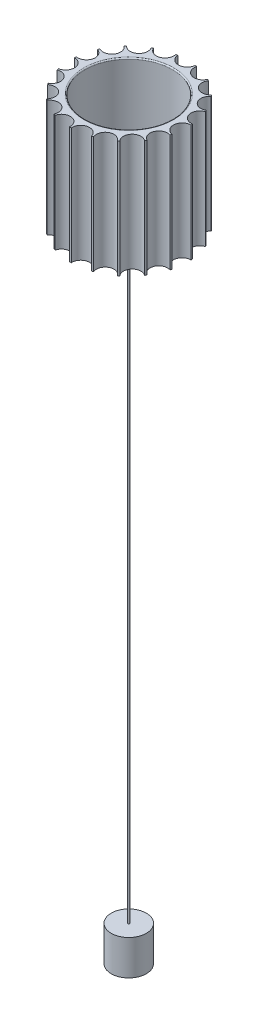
ISO-10303-21;
HEADER;
FILE_DESCRIPTION(('STEP AP214'),'2;1');
FILE_NAME('part.step','',(''),(''),'','','');
FILE_SCHEMA(('AUTOMOTIVE_DESIGN { 1 0 10303 214 1 1 1 1 }'));
ENDSEC;
DATA;
#1=APPLICATION_CONTEXT('core data for automotive mechanical design processes');
#2=APPLICATION_PROTOCOL_DEFINITION('international standard','automotive_design',2000,#1);
#3=PRODUCT_CONTEXT('',#1,'mechanical');
#4=PRODUCT('Part','Part','',(#3));
#5=PRODUCT_RELATED_PRODUCT_CATEGORY('part','',(#4));
#6=PRODUCT_DEFINITION_FORMATION('','',#4);
#7=PRODUCT_DEFINITION_CONTEXT('part definition',#1,'design');
#8=PRODUCT_DEFINITION('design','',#6,#7);
#9=PRODUCT_DEFINITION_SHAPE('','',#8);
#10=(LENGTH_UNIT() NAMED_UNIT(*) SI_UNIT(.MILLI.,.METRE.));
#11=(NAMED_UNIT(*) PLANE_ANGLE_UNIT() SI_UNIT($,.RADIAN.));
#12=(NAMED_UNIT(*) SI_UNIT($,.STERADIAN.) SOLID_ANGLE_UNIT());
#13=UNCERTAINTY_MEASURE_WITH_UNIT(LENGTH_MEASURE(1.E-05),#10,'distance_accuracy_value','');
#14=(GEOMETRIC_REPRESENTATION_CONTEXT(3) GLOBAL_UNCERTAINTY_ASSIGNED_CONTEXT((#13)) GLOBAL_UNIT_ASSIGNED_CONTEXT((#10,
#11,#12)) REPRESENTATION_CONTEXT('',''));
#15=CARTESIAN_POINT('',(0.,0.,0.));
#16=DIRECTION('',(0.,0.,1.));
#17=DIRECTION('',(1.,0.,0.));
#18=AXIS2_PLACEMENT_3D('',#15,#16,#17);
#19=CARTESIAN_POINT('',(0.,-1090.,0.));
#20=DIRECTION('',(0.,1.,0.));
#21=DIRECTION('',(0.,0.,1.));
#22=AXIS2_PLACEMENT_3D('',#19,#20,#21);
#23=CYLINDRICAL_SURFACE('',#22,30.);
#24=CARTESIAN_POINT('',(0.,-1090.,0.));
#25=DIRECTION('',(0.,-1.,0.));
#26=DIRECTION('',(0.,0.,-1.));
#27=AXIS2_PLACEMENT_3D('',#24,#25,#26);
#28=CIRCLE('',#27,30.);
#29=CARTESIAN_POINT('',(0.,-1090.,-30.));
#30=VERTEX_POINT('',#29);
#31=EDGE_CURVE('E11',#30,#30,#28,.T.);
#32=ORIENTED_EDGE('',*,*,#31,.F.);
#33=EDGE_LOOP('',(#32));
#34=FACE_BOUND('',#33,.T.);
#35=CARTESIAN_POINT('',(0.,-1030.,0.));
#36=DIRECTION('',(0.,-1.,0.));
#37=DIRECTION('',(0.,0.,-1.));
#38=AXIS2_PLACEMENT_3D('',#35,#36,#37);
#39=CIRCLE('',#38,30.);
#40=CARTESIAN_POINT('',(0.,-1030.,-30.));
#41=VERTEX_POINT('',#40);
#42=EDGE_CURVE('E42',#41,#41,#39,.T.);
#43=ORIENTED_EDGE('',*,*,#42,.T.);
#44=EDGE_LOOP('',(#43));
#45=FACE_BOUND('',#44,.T.);
#46=ADVANCED_FACE('F39',(#34,#45),#23,.T.);
#47=CARTESIAN_POINT('',(0.,-1090.,0.));
#48=DIRECTION('',(0.,-1.,0.));
#49=DIRECTION('',(0.,0.,-1.));
#50=AXIS2_PLACEMENT_3D('',#47,#48,#49);
#51=PLANE('',#50);
#52=ORIENTED_EDGE('',*,*,#31,.T.);
#53=EDGE_LOOP('',(#52));
#54=FACE_BOUND('',#53,.T.);
#55=ADVANCED_FACE('F54',(#54),#51,.T.);
#56=CARTESIAN_POINT('',(0.,-1030.,0.));
#57=DIRECTION('',(0.,-1.,0.));
#58=DIRECTION('',(0.,0.,-1.));
#59=AXIS2_PLACEMENT_3D('',#56,#57,#58);
#60=PLANE('',#59);
#61=ORIENTED_EDGE('',*,*,#42,.F.);
#62=EDGE_LOOP('',(#61));
#63=FACE_BOUND('',#62,.T.);
#64=ADVANCED_FACE('F52',(#63),#60,.F.);
#65=CLOSED_SHELL('',(#46,#55,#64));
#66=MANIFOLD_SOLID_BREP('B2',#65);
#67=CARTESIAN_POINT('',(0.,-1030.,0.));
#68=DIRECTION('',(0.,1.,0.));
#69=DIRECTION('',(0.,0.,1.));
#70=AXIS2_PLACEMENT_3D('',#67,#68,#69);
#71=CYLINDRICAL_SURFACE('',#70,1.5);
#72=CARTESIAN_POINT('',(0.,-1030.,0.));
#73=DIRECTION('',(0.,-1.,0.));
#74=DIRECTION('',(0.,0.,-1.));
#75=AXIS2_PLACEMENT_3D('',#72,#73,#74);
#76=CIRCLE('',#75,1.5);
#77=CARTESIAN_POINT('',(0.,-1030.,-1.5));
#78=VERTEX_POINT('',#77);
#79=EDGE_CURVE('E38',#78,#78,#76,.T.);
#80=ORIENTED_EDGE('',*,*,#79,.F.);
#81=EDGE_LOOP('',(#80));
#82=FACE_BOUND('',#81,.T.);
#83=CARTESIAN_POINT('',(0.,-30.,0.));
#84=DIRECTION('',(0.,-1.,0.));
#85=DIRECTION('',(0.,0.,-1.));
#86=AXIS2_PLACEMENT_3D('',#83,#84,#85);
#87=CIRCLE('',#86,1.5);
#88=CARTESIAN_POINT('',(0.,-30.,-1.5));
#89=VERTEX_POINT('',#88);
#90=EDGE_CURVE('E90',#89,#89,#87,.T.);
#91=ORIENTED_EDGE('',*,*,#90,.T.);
#92=EDGE_LOOP('',(#91));
#93=FACE_BOUND('',#92,.T.);
#94=ADVANCED_FACE('F87',(#82,#93),#71,.T.);
#95=CARTESIAN_POINT('',(0.,-1030.,0.));
#96=DIRECTION('',(0.,-1.,0.));
#97=DIRECTION('',(0.,0.,-1.));
#98=AXIS2_PLACEMENT_3D('',#95,#96,#97);
#99=PLANE('',#98);
#100=ORIENTED_EDGE('',*,*,#79,.T.);
#101=EDGE_LOOP('',(#100));
#102=FACE_BOUND('',#101,.T.);
#103=ADVANCED_FACE('F102',(#102),#99,.T.);
#104=CARTESIAN_POINT('',(0.,-30.,0.));
#105=DIRECTION('',(0.,-1.,0.));
#106=DIRECTION('',(0.,0.,-1.));
#107=AXIS2_PLACEMENT_3D('',#104,#105,#106);
#108=PLANE('',#107);
#109=ORIENTED_EDGE('',*,*,#90,.F.);
#110=EDGE_LOOP('',(#109));
#111=FACE_BOUND('',#110,.T.);
#112=ADVANCED_FACE('F100',(#111),#108,.F.);
#113=CLOSED_SHELL('',(#94,#103,#112));
#114=MANIFOLD_SOLID_BREP('B6',#113);
#115=CARTESIAN_POINT('',(0.,-30.,0.));
#116=DIRECTION('',(0.,1.,0.));
#117=DIRECTION('',(0.,0.,1.));
#118=AXIS2_PLACEMENT_3D('',#115,#116,#117);
#119=CYLINDRICAL_SURFACE('',#118,5.);
#120=CARTESIAN_POINT('',(0.,-30.,0.));
#121=DIRECTION('',(0.,-1.,0.));
#122=DIRECTION('',(0.,0.,-1.));
#123=AXIS2_PLACEMENT_3D('',#120,#121,#122);
#124=CIRCLE('',#123,5.);
#125=CARTESIAN_POINT('',(0.,-30.,-5.));
#126=VERTEX_POINT('',#125);
#127=EDGE_CURVE('E86',#126,#126,#124,.T.);
#128=ORIENTED_EDGE('',*,*,#127,.F.);
#129=EDGE_LOOP('',(#128));
#130=FACE_BOUND('',#129,.T.);
#131=CARTESIAN_POINT('',(0.,0.,0.));
#132=DIRECTION('',(0.,-1.,0.));
#133=DIRECTION('',(0.,0.,-1.));
#134=AXIS2_PLACEMENT_3D('',#131,#132,#133);
#135=CIRCLE('',#134,5.);
#136=CARTESIAN_POINT('',(0.,0.,-5.));
#137=VERTEX_POINT('',#136);
#138=EDGE_CURVE('E139',#137,#137,#135,.T.);
#139=ORIENTED_EDGE('',*,*,#138,.T.);
#140=EDGE_LOOP('',(#139));
#141=FACE_BOUND('',#140,.T.);
#142=ADVANCED_FACE('F136',(#130,#141),#119,.T.);
#143=CARTESIAN_POINT('',(0.,-30.,0.));
#144=DIRECTION('',(0.,-1.,0.));
#145=DIRECTION('',(0.,0.,-1.));
#146=AXIS2_PLACEMENT_3D('',#143,#144,#145);
#147=PLANE('',#146);
#148=ORIENTED_EDGE('',*,*,#127,.T.);
#149=EDGE_LOOP('',(#148));
#150=FACE_BOUND('',#149,.T.);
#151=ADVANCED_FACE('F151',(#150),#147,.T.);
#152=CARTESIAN_POINT('',(0.,0.,0.));
#153=DIRECTION('',(0.,-1.,0.));
#154=DIRECTION('',(0.,0.,-1.));
#155=AXIS2_PLACEMENT_3D('',#152,#153,#154);
#156=PLANE('',#155);
#157=ORIENTED_EDGE('',*,*,#138,.F.);
#158=EDGE_LOOP('',(#157));
#159=FACE_BOUND('',#158,.T.);
#160=ADVANCED_FACE('F149',(#159),#156,.F.);
#161=CLOSED_SHELL('',(#142,#151,#160));
#162=MANIFOLD_SOLID_BREP('B33',#161);
#163=CARTESIAN_POINT('',(0.,200.,0.));
#164=DIRECTION('',(0.,-1.,0.));
#165=DIRECTION('',(0.,0.,-1.));
#166=AXIS2_PLACEMENT_3D('',#163,#164,#165);
#167=CYLINDRICAL_SURFACE('',#166,100.);
#168=CARTESIAN_POINT('',(0.,0.,0.));
#169=DIRECTION('',(0.,1.,0.));
#170=DIRECTION('',(0.,0.,1.));
#171=AXIS2_PLACEMENT_3D('',#168,#169,#170);
#172=CIRCLE('',#171,100.);
#173=CARTESIAN_POINT('',(-1.52054136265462,0.,99.9884391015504));
#174=VERTEX_POINT('',#173);
#175=CARTESIAN_POINT('',(1.52054136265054,0.,99.9884391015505));
#176=VERTEX_POINT('',#175);
#177=EDGE_CURVE('E455',#174,#176,#172,.T.);
#178=ORIENTED_EDGE('',*,*,#177,.T.);
#179=DIRECTION('',(0.,1.,0.));
#180=VECTOR('',#179,1.);
#181=CARTESIAN_POINT('',(1.52054136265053,100.,99.9884391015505));
#182=LINE('',#181,#180);
#183=CARTESIAN_POINT('',(1.52054136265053,200.,99.9884391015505));
#184=VERTEX_POINT('',#183);
#185=EDGE_CURVE('E459',#176,#184,#182,.T.);
#186=ORIENTED_EDGE('',*,*,#185,.T.);
#187=CARTESIAN_POINT('',(0.,200.,0.));
#188=DIRECTION('',(0.,1.,0.));
#189=DIRECTION('',(0.,0.,1.));
#190=AXIS2_PLACEMENT_3D('',#187,#188,#189);
#191=CIRCLE('',#190,100.);
#192=CARTESIAN_POINT('',(-1.52054136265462,200.,99.9884391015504));
#193=VERTEX_POINT('',#192);
#194=EDGE_CURVE('E461',#193,#184,#191,.T.);
#195=ORIENTED_EDGE('',*,*,#194,.F.);
#196=DIRECTION('',(0.,1.,0.));
#197=VECTOR('',#196,1.);
#198=CARTESIAN_POINT('',(-1.52054136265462,100.,99.9884391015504));
#199=LINE('',#198,#197);
#200=EDGE_CURVE('E673',#193,#174,#199,.F.);
#201=ORIENTED_EDGE('',*,*,#200,.T.);
#202=EDGE_LOOP('',(#178,#186,#195,#201));
#203=FACE_BOUND('',#202,.T.);
#204=ADVANCED_FACE('F176',(#203),#167,.T.);
#205=CARTESIAN_POINT('',(-33.9043473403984,0.,94.0770706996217));
#206=VERTEX_POINT('',#205);
#207=CARTESIAN_POINT('',(-31.0280388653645,0.,95.0645086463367));
#208=VERTEX_POINT('',#207);
#209=EDGE_CURVE('E458',#206,#208,#172,.T.);
#210=ORIENTED_EDGE('',*,*,#209,.T.);
#211=DIRECTION('',(0.,1.,0.));
#212=VECTOR('',#211,1.);
#213=CARTESIAN_POINT('',(-31.0280388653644,100.,95.0645086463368));
#214=LINE('',#213,#212);
#215=CARTESIAN_POINT('',(-31.0280388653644,200.,95.0645086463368));
#216=VERTEX_POINT('',#215);
#217=EDGE_CURVE('E191',#208,#216,#214,.T.);
#218=ORIENTED_EDGE('',*,*,#217,.T.);
#219=CARTESIAN_POINT('',(-33.9043473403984,200.,94.0770706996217));
#220=VERTEX_POINT('',#219);
#221=EDGE_CURVE('E558',#220,#216,#191,.T.);
#222=ORIENTED_EDGE('',*,*,#221,.F.);
#223=DIRECTION('',(0.,1.,0.));
#224=VECTOR('',#223,1.);
#225=CARTESIAN_POINT('',(-33.9043473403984,100.,94.0770706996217));
#226=LINE('',#225,#224);
#227=EDGE_CURVE('E663',#220,#206,#226,.F.);
#228=ORIENTED_EDGE('',*,*,#227,.T.);
#229=EDGE_LOOP('',(#210,#218,#222,#228));
#230=FACE_BOUND('',#229,.T.);
#231=ADVANCED_FACE('F501',(#230),#167,.T.);
#232=CARTESIAN_POINT('',(-84.5386267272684,0.,53.4155463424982));
#233=VERTEX_POINT('',#232);
#234=CARTESIAN_POINT('',(-82.8753121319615,0.,55.9614388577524));
#235=VERTEX_POINT('',#234);
#236=EDGE_CURVE('E879',#233,#235,#172,.T.);
#237=ORIENTED_EDGE('',*,*,#236,.T.);
#238=DIRECTION('',(0.,1.,0.));
#239=VECTOR('',#238,1.);
#240=CARTESIAN_POINT('',(-82.8753121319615,100.,55.9614388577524));
#241=LINE('',#240,#239);
#242=CARTESIAN_POINT('',(-82.8753121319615,200.,55.9614388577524));
#243=VERTEX_POINT('',#242);
#244=EDGE_CURVE('E670',#235,#243,#241,.T.);
#245=ORIENTED_EDGE('',*,*,#244,.T.);
#246=CARTESIAN_POINT('',(-84.5386267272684,200.,53.4155463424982));
#247=VERTEX_POINT('',#246);
#248=EDGE_CURVE('E550',#247,#243,#191,.T.);
#249=ORIENTED_EDGE('',*,*,#248,.F.);
#250=DIRECTION('',(0.,1.,0.));
#251=VECTOR('',#250,1.);
#252=CARTESIAN_POINT('',(-84.5386267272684,100.,53.4155463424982));
#253=LINE('',#252,#251);
#254=EDGE_CURVE('E657',#247,#233,#253,.F.);
#255=ORIENTED_EDGE('',*,*,#254,.T.);
#256=EDGE_LOOP('',(#237,#245,#249,#255));
#257=FACE_BOUND('',#256,.T.);
#258=ADVANCED_FACE('F507',(#257),#167,.T.);
#259=CARTESIAN_POINT('',(-62.6140912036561,200.,77.970991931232));
#260=VERTEX_POINT('',#259);
#261=CARTESIAN_POINT('',(-60.2142496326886,200.,79.8388636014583));
#262=VERTEX_POINT('',#261);
#263=EDGE_CURVE('E554',#260,#262,#191,.T.);
#264=ORIENTED_EDGE('',*,*,#263,.F.);
#265=DIRECTION('',(0.,1.,0.));
#266=VECTOR('',#265,1.);
#267=CARTESIAN_POINT('',(-62.6140912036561,100.,77.970991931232));
#268=LINE('',#267,#266);
#269=CARTESIAN_POINT('',(-62.6140912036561,0.,77.970991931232));
#270=VERTEX_POINT('',#269);
#271=EDGE_CURVE('E667',#260,#270,#268,.F.);
#272=ORIENTED_EDGE('',*,*,#271,.T.);
#273=CARTESIAN_POINT('',(-60.2142496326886,0.,79.8388636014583));
#274=VERTEX_POINT('',#273);
#275=EDGE_CURVE('E883',#270,#274,#172,.T.);
#276=ORIENTED_EDGE('',*,*,#275,.T.);
#277=DIRECTION('',(0.,1.,0.));
#278=VECTOR('',#277,1.);
#279=CARTESIAN_POINT('',(-60.2142496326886,100.,79.8388636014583));
#280=LINE('',#279,#278);
#281=EDGE_CURVE('E199',#274,#262,#280,.T.);
#282=ORIENTED_EDGE('',*,*,#281,.T.);
#283=EDGE_LOOP('',(#264,#272,#276,#282));
#284=FACE_BOUND('',#283,.T.);
#285=ADVANCED_FACE('F1036',(#284),#167,.T.);
#286=CARTESIAN_POINT('',(-97.3020902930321,0.,23.0716974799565));
#287=VERTEX_POINT('',#286);
#288=CARTESIAN_POINT('',(-96.5555486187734,0.,26.019723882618));
#289=VERTEX_POINT('',#288);
#290=EDGE_CURVE('E875',#287,#289,#172,.T.);
#291=ORIENTED_EDGE('',*,*,#290,.T.);
#292=DIRECTION('',(0.,1.,0.));
#293=VECTOR('',#292,1.);
#294=CARTESIAN_POINT('',(-96.5555486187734,100.,26.0197238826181));
#295=LINE('',#294,#293);
#296=CARTESIAN_POINT('',(-96.5555486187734,200.,26.0197238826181));
#297=VERTEX_POINT('',#296);
#298=EDGE_CURVE('E660',#289,#297,#295,.T.);
#299=ORIENTED_EDGE('',*,*,#298,.T.);
#300=CARTESIAN_POINT('',(-97.3020902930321,200.,23.0716974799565));
#301=VERTEX_POINT('',#300);
#302=EDGE_CURVE('E546',#301,#297,#191,.T.);
#303=ORIENTED_EDGE('',*,*,#302,.F.);
#304=DIRECTION('',(0.,1.,0.));
#305=VECTOR('',#304,1.);
#306=CARTESIAN_POINT('',(-97.3020902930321,100.,23.0716974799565));
#307=LINE('',#306,#305);
#308=EDGE_CURVE('E651',#301,#287,#307,.F.);
#309=ORIENTED_EDGE('',*,*,#308,.T.);
#310=EDGE_LOOP('',(#291,#299,#303,#309));
#311=FACE_BOUND('',#310,.T.);
#312=ADVANCED_FACE('F1028',(#311),#167,.T.);
#313=CARTESIAN_POINT('',(-99.5213625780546,0.,-9.77232779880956));
#314=VERTEX_POINT('',#313);
#315=CARTESIAN_POINT('',(-99.7724931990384,0.,-6.74163191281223));
#316=VERTEX_POINT('',#315);
#317=EDGE_CURVE('E871',#314,#316,#172,.T.);
#318=ORIENTED_EDGE('',*,*,#317,.T.);
#319=DIRECTION('',(0.,1.,0.));
#320=VECTOR('',#319,1.);
#321=CARTESIAN_POINT('',(-99.7724931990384,100.,-6.74163191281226));
#322=LINE('',#321,#320);
#323=CARTESIAN_POINT('',(-99.7724931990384,200.,-6.74163191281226));
#324=VERTEX_POINT('',#323);
#325=EDGE_CURVE('E654',#316,#324,#322,.T.);
#326=ORIENTED_EDGE('',*,*,#325,.T.);
#327=CARTESIAN_POINT('',(-99.5213625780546,200.,-9.77232779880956));
#328=VERTEX_POINT('',#327);
#329=EDGE_CURVE('E542',#328,#324,#191,.T.);
#330=ORIENTED_EDGE('',*,*,#329,.F.);
#331=DIRECTION('',(0.,1.,0.));
#332=VECTOR('',#331,1.);
#333=CARTESIAN_POINT('',(-99.5213625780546,100.,-9.77232779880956));
#334=LINE('',#333,#332);
#335=EDGE_CURVE('E645',#328,#314,#334,.F.);
#336=ORIENTED_EDGE('',*,*,#335,.T.);
#337=EDGE_LOOP('',(#318,#326,#330,#336));
#338=FACE_BOUND('',#337,.T.);
#339=ADVANCED_FACE('F1020',(#338),#167,.T.);
#340=CARTESIAN_POINT('',(-90.9559509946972,0.,-41.5573697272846));
#341=VERTEX_POINT('',#340);
#342=CARTESIAN_POINT('',(-92.1775400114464,0.,-38.7724272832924));
#343=VERTEX_POINT('',#342);
#344=EDGE_CURVE('E869',#341,#343,#172,.T.);
#345=ORIENTED_EDGE('',*,*,#344,.T.);
#346=DIRECTION('',(0.,1.,0.));
#347=VECTOR('',#346,1.);
#348=CARTESIAN_POINT('',(-92.1775400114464,100.,-38.7724272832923));
#349=LINE('',#348,#347);
#350=CARTESIAN_POINT('',(-92.1775400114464,200.,-38.7724272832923));
#351=VERTEX_POINT('',#350);
#352=EDGE_CURVE('E648',#343,#351,#349,.T.);
#353=ORIENTED_EDGE('',*,*,#352,.T.);
#354=CARTESIAN_POINT('',(-90.9559509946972,200.,-41.5573697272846));
#355=VERTEX_POINT('',#354);
#356=EDGE_CURVE('E538',#355,#351,#191,.T.);
#357=ORIENTED_EDGE('',*,*,#356,.F.);
#358=DIRECTION('',(0.,1.,0.));
#359=VECTOR('',#358,1.);
#360=CARTESIAN_POINT('',(-90.9559509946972,100.,-41.5573697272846));
#361=LINE('',#360,#359);
#362=EDGE_CURVE('E639',#355,#341,#361,.F.);
#363=ORIENTED_EDGE('',*,*,#362,.T.);
#364=EDGE_LOOP('',(#345,#353,#357,#363));
#365=FACE_BOUND('',#364,.T.);
#366=ADVANCED_FACE('F1012',(#365),#167,.T.);
#367=CARTESIAN_POINT('',(-72.5340507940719,0.,-68.8390258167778));
#368=VERTEX_POINT('',#367);
#369=CARTESIAN_POINT('',(-74.5937200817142,0.,-66.6016285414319));
#370=VERTEX_POINT('',#369);
#371=EDGE_CURVE('E454',#368,#370,#172,.T.);
#372=ORIENTED_EDGE('',*,*,#371,.T.);
#373=DIRECTION('',(0.,1.,0.));
#374=VECTOR('',#373,1.);
#375=CARTESIAN_POINT('',(-74.5937200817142,100.,-66.6016285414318));
#376=LINE('',#375,#374);
#377=CARTESIAN_POINT('',(-74.5937200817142,200.,-66.6016285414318));
#378=VERTEX_POINT('',#377);
#379=EDGE_CURVE('E642',#370,#378,#376,.T.);
#380=ORIENTED_EDGE('',*,*,#379,.T.);
#381=CARTESIAN_POINT('',(-72.5340507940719,200.,-68.8390258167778));
#382=VERTEX_POINT('',#381);
#383=EDGE_CURVE('E534',#382,#378,#191,.T.);
#384=ORIENTED_EDGE('',*,*,#383,.F.);
#385=DIRECTION('',(0.,1.,0.));
#386=VECTOR('',#385,1.);
#387=CARTESIAN_POINT('',(-72.5340507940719,100.,-68.8390258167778));
#388=LINE('',#387,#386);
#389=EDGE_CURVE('E734',#382,#368,#388,.F.);
#390=ORIENTED_EDGE('',*,*,#389,.T.);
#391=EDGE_LOOP('',(#372,#380,#384,#390));
#392=FACE_BOUND('',#391,.T.);
#393=ADVANCED_FACE('F867',(#392),#167,.T.);
#394=CARTESIAN_POINT('',(96.5555486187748,0.,26.019723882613));
#395=VERTEX_POINT('',#394);
#396=CARTESIAN_POINT('',(97.30209029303,0.,23.0716974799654));
#397=VERTEX_POINT('',#396);
#398=EDGE_CURVE('E768',#395,#397,#172,.T.);
#399=ORIENTED_EDGE('',*,*,#398,.T.);
#400=DIRECTION('',(0.,1.,0.));
#401=VECTOR('',#400,1.);
#402=CARTESIAN_POINT('',(97.30209029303,100.,23.0716974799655));
#403=LINE('',#402,#401);
#404=CARTESIAN_POINT('',(97.30209029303,200.,23.0716974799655));
#405=VERTEX_POINT('',#404);
#406=EDGE_CURVE('E636',#397,#405,#403,.T.);
#407=ORIENTED_EDGE('',*,*,#406,.T.);
#408=CARTESIAN_POINT('',(96.5555486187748,200.,26.019723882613));
#409=VERTEX_POINT('',#408);
#410=EDGE_CURVE('E578',#409,#405,#191,.T.);
#411=ORIENTED_EDGE('',*,*,#410,.F.);
#412=DIRECTION('',(0.,1.,0.));
#413=VECTOR('',#412,1.);
#414=CARTESIAN_POINT('',(96.5555486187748,100.,26.0197238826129));
#415=LINE('',#414,#413);
#416=EDGE_CURVE('E627',#409,#395,#415,.F.);
#417=ORIENTED_EDGE('',*,*,#416,.T.);
#418=EDGE_LOOP('',(#399,#407,#411,#417));
#419=FACE_BOUND('',#418,.T.);
#420=ADVANCED_FACE('F814',(#419),#167,.T.);
#421=CARTESIAN_POINT('',(82.8753121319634,0.,55.9614388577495));
#422=VERTEX_POINT('',#421);
#423=CARTESIAN_POINT('',(84.5386267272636,0.,53.4155463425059));
#424=VERTEX_POINT('',#423);
#425=EDGE_CURVE('E772',#422,#424,#172,.T.);
#426=ORIENTED_EDGE('',*,*,#425,.T.);
#427=DIRECTION('',(0.,1.,0.));
#428=VECTOR('',#427,1.);
#429=CARTESIAN_POINT('',(84.5386267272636,100.,53.4155463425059));
#430=LINE('',#429,#428);
#431=CARTESIAN_POINT('',(84.5386267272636,200.,53.4155463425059));
#432=VERTEX_POINT('',#431);
#433=EDGE_CURVE('E630',#424,#432,#430,.T.);
#434=ORIENTED_EDGE('',*,*,#433,.T.);
#435=CARTESIAN_POINT('',(82.8753121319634,200.,55.9614388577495));
#436=VERTEX_POINT('',#435);
#437=EDGE_CURVE('E574',#436,#432,#191,.T.);
#438=ORIENTED_EDGE('',*,*,#437,.F.);
#439=DIRECTION('',(0.,1.,0.));
#440=VECTOR('',#439,1.);
#441=CARTESIAN_POINT('',(82.8753121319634,100.,55.9614388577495));
#442=LINE('',#441,#440);
#443=EDGE_CURVE('E608',#436,#422,#442,.F.);
#444=ORIENTED_EDGE('',*,*,#443,.T.);
#445=EDGE_LOOP('',(#426,#434,#438,#444));
#446=FACE_BOUND('',#445,.T.);
#447=ADVANCED_FACE('F784',(#446),#167,.T.);
#448=CARTESIAN_POINT('',(31.0280388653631,200.,95.0645086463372));
#449=VERTEX_POINT('',#448);
#450=CARTESIAN_POINT('',(33.9043473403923,200.,94.0770706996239));
#451=VERTEX_POINT('',#450);
#452=EDGE_CURVE('E432',#449,#451,#191,.T.);
#453=ORIENTED_EDGE('',*,*,#452,.F.);
#454=DIRECTION('',(0.,1.,0.));
#455=VECTOR('',#454,1.);
#456=CARTESIAN_POINT('',(31.0280388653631,100.,95.0645086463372));
#457=LINE('',#456,#455);
#458=CARTESIAN_POINT('',(31.0280388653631,0.,95.0645086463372));
#459=VERTEX_POINT('',#458);
#460=EDGE_CURVE('E677',#449,#459,#457,.F.);
#461=ORIENTED_EDGE('',*,*,#460,.T.);
#462=CARTESIAN_POINT('',(33.9043473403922,0.,94.0770706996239));
#463=VERTEX_POINT('',#462);
#464=EDGE_CURVE('E460',#459,#463,#172,.T.);
#465=ORIENTED_EDGE('',*,*,#464,.T.);
#466=DIRECTION('',(0.,1.,0.));
#467=VECTOR('',#466,1.);
#468=CARTESIAN_POINT('',(33.9043473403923,100.,94.0770706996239));
#469=LINE('',#468,#467);
#470=EDGE_CURVE('E624',#463,#451,#469,.T.);
#471=ORIENTED_EDGE('',*,*,#470,.T.);
#472=EDGE_LOOP('',(#453,#461,#465,#471));
#473=FACE_BOUND('',#472,.T.);
#474=ADVANCED_FACE('F806',(#473),#167,.T.);
#475=CARTESIAN_POINT('',(60.2142496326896,200.,79.8388636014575));
#476=VERTEX_POINT('',#475);
#477=CARTESIAN_POINT('',(62.6140912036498,200.,77.970991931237));
#478=VERTEX_POINT('',#477);
#479=EDGE_CURVE('E570',#476,#478,#191,.T.);
#480=ORIENTED_EDGE('',*,*,#479,.F.);
#481=DIRECTION('',(0.,1.,0.));
#482=VECTOR('',#481,1.);
#483=CARTESIAN_POINT('',(60.2142496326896,100.,79.8388636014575));
#484=LINE('',#483,#482);
#485=CARTESIAN_POINT('',(60.2142496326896,0.,79.8388636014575));
#486=VERTEX_POINT('',#485);
#487=EDGE_CURVE('E621',#476,#486,#484,.F.);
#488=ORIENTED_EDGE('',*,*,#487,.T.);
#489=CARTESIAN_POINT('',(62.6140912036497,0.,77.9709919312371));
#490=VERTEX_POINT('',#489);
#491=EDGE_CURVE('E568',#486,#490,#172,.T.);
#492=ORIENTED_EDGE('',*,*,#491,.T.);
#493=DIRECTION('',(0.,1.,0.));
#494=VECTOR('',#493,1.);
#495=CARTESIAN_POINT('',(62.6140912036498,100.,77.970991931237));
#496=LINE('',#495,#494);
#497=EDGE_CURVE('E612',#490,#478,#496,.T.);
#498=ORIENTED_EDGE('',*,*,#497,.T.);
#499=EDGE_LOOP('',(#480,#488,#492,#498));
#500=FACE_BOUND('',#499,.T.);
#501=ADVANCED_FACE('F781',(#500),#167,.T.);
#502=CARTESIAN_POINT('',(74.5937200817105,0.,-66.601628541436));
#503=VERTEX_POINT('',#502);
#504=CARTESIAN_POINT('',(72.5340507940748,0.,-68.8390258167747));
#505=VERTEX_POINT('',#504);
#506=EDGE_CURVE('E606',#503,#505,#172,.T.);
#507=ORIENTED_EDGE('',*,*,#506,.T.);
#508=DIRECTION('',(0.,1.,0.));
#509=VECTOR('',#508,1.);
#510=CARTESIAN_POINT('',(72.5340507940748,100.,-68.8390258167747));
#511=LINE('',#510,#509);
#512=CARTESIAN_POINT('',(72.5340507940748,200.,-68.8390258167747));
#513=VERTEX_POINT('',#512);
#514=EDGE_CURVE('E605',#505,#513,#511,.T.);
#515=ORIENTED_EDGE('',*,*,#514,.T.);
#516=CARTESIAN_POINT('',(74.5937200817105,200.,-66.601628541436));
#517=VERTEX_POINT('',#516);
#518=EDGE_CURVE('E530',#517,#513,#191,.T.);
#519=ORIENTED_EDGE('',*,*,#518,.F.);
#520=DIRECTION('',(0.,1.,0.));
#521=VECTOR('',#520,1.);
#522=CARTESIAN_POINT('',(74.5937200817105,100.,-66.601628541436));
#523=LINE('',#522,#521);
#524=EDGE_CURVE('E603',#517,#503,#523,.F.);
#525=ORIENTED_EDGE('',*,*,#524,.T.);
#526=EDGE_LOOP('',(#507,#515,#519,#525));
#527=FACE_BOUND('',#526,.T.);
#528=ADVANCED_FACE('F602',(#527),#167,.T.);
#529=CARTESIAN_POINT('',(48.9265131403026,200.,-87.2135099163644));
#530=VERTEX_POINT('',#529);
#531=CARTESIAN_POINT('',(46.251960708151,200.,-88.6609053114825));
#532=VERTEX_POINT('',#531);
#533=EDGE_CURVE('E528',#530,#532,#191,.T.);
#534=ORIENTED_EDGE('',*,*,#533,.F.);
#535=DIRECTION('',(0.,1.,0.));
#536=VECTOR('',#535,1.);
#537=CARTESIAN_POINT('',(48.9265131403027,100.,-87.2135099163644));
#538=LINE('',#537,#536);
#539=CARTESIAN_POINT('',(48.9265131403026,0.,-87.2135099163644));
#540=VERTEX_POINT('',#539);
#541=EDGE_CURVE('E609',#530,#540,#538,.F.);
#542=ORIENTED_EDGE('',*,*,#541,.T.);
#543=CARTESIAN_POINT('',(46.251960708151,0.,-88.6609053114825));
#544=VERTEX_POINT('',#543);
#545=EDGE_CURVE('E452',#540,#544,#172,.T.);
#546=ORIENTED_EDGE('',*,*,#545,.T.);
#547=DIRECTION('',(0.,1.,0.));
#548=VECTOR('',#547,1.);
#549=CARTESIAN_POINT('',(46.251960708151,100.,-88.6609053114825));
#550=LINE('',#549,#548);
#551=EDGE_CURVE('E615',#544,#532,#550,.T.);
#552=ORIENTED_EDGE('',*,*,#551,.T.);
#553=EDGE_LOOP('',(#534,#542,#546,#552));
#554=FACE_BOUND('',#553,.T.);
#555=ADVANCED_FACE('F758',(#554),#167,.T.);
#556=CARTESIAN_POINT('',(92.177540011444,0.,-38.7724272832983));
#557=VERTEX_POINT('',#556);
#558=CARTESIAN_POINT('',(90.9559509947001,0.,-41.5573697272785));
#559=VERTEX_POINT('',#558);
#560=EDGE_CURVE('E762',#557,#559,#172,.T.);
#561=ORIENTED_EDGE('',*,*,#560,.T.);
#562=DIRECTION('',(0.,1.,0.));
#563=VECTOR('',#562,1.);
#564=CARTESIAN_POINT('',(90.9559509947,100.,-41.5573697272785));
#565=LINE('',#564,#563);
#566=CARTESIAN_POINT('',(90.9559509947,200.,-41.5573697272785));
#567=VERTEX_POINT('',#566);
#568=EDGE_CURVE('E752',#559,#567,#565,.T.);
#569=ORIENTED_EDGE('',*,*,#568,.T.);
#570=CARTESIAN_POINT('',(92.177540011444,200.,-38.7724272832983));
#571=VERTEX_POINT('',#570);
#572=EDGE_CURVE('E586',#571,#567,#191,.T.);
#573=ORIENTED_EDGE('',*,*,#572,.F.);
#574=DIRECTION('',(0.,1.,0.));
#575=VECTOR('',#574,1.);
#576=CARTESIAN_POINT('',(92.177540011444,100.,-38.7724272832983));
#577=LINE('',#576,#575);
#578=EDGE_CURVE('E745',#571,#557,#577,.F.);
#579=ORIENTED_EDGE('',*,*,#578,.T.);
#580=EDGE_LOOP('',(#561,#569,#573,#579));
#581=FACE_BOUND('',#580,.T.);
#582=ADVANCED_FACE('F794',(#581),#167,.T.);
#583=CARTESIAN_POINT('',(99.7724931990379,200.,-6.74163191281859));
#584=VERTEX_POINT('',#583);
#585=CARTESIAN_POINT('',(99.5213625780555,200.,-9.77232779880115));
#586=VERTEX_POINT('',#585);
#587=EDGE_CURVE('E582',#584,#586,#191,.T.);
#588=ORIENTED_EDGE('',*,*,#587,.F.);
#589=DIRECTION('',(0.,1.,0.));
#590=VECTOR('',#589,1.);
#591=CARTESIAN_POINT('',(99.7724931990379,100.,-6.74163191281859));
#592=LINE('',#591,#590);
#593=CARTESIAN_POINT('',(99.7724931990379,0.,-6.74163191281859));
#594=VERTEX_POINT('',#593);
#595=EDGE_CURVE('E633',#584,#594,#592,.F.);
#596=ORIENTED_EDGE('',*,*,#595,.T.);
#597=CARTESIAN_POINT('',(99.5213625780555,0.,-9.7723277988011));
#598=VERTEX_POINT('',#597);
#599=EDGE_CURVE('E764',#594,#598,#172,.T.);
#600=ORIENTED_EDGE('',*,*,#599,.T.);
#601=DIRECTION('',(0.,1.,0.));
#602=VECTOR('',#601,1.);
#603=CARTESIAN_POINT('',(99.5213625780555,100.,-9.77232779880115));
#604=LINE('',#603,#602);
#605=EDGE_CURVE('E748',#598,#586,#604,.T.);
#606=ORIENTED_EDGE('',*,*,#605,.T.);
#607=EDGE_LOOP('',(#588,#596,#600,#606));
#608=FACE_BOUND('',#607,.T.);
#609=ADVANCED_FACE('F789',(#608),#167,.T.);
#610=CARTESIAN_POINT('',(-14.9577530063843,0.,-98.875));
#611=VERTEX_POINT('',#610);
#612=CARTESIAN_POINT('',(-17.9573593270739,0.,-98.3744542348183));
#613=VERTEX_POINT('',#612);
#614=EDGE_CURVE('E439',#611,#613,#172,.T.);
#615=ORIENTED_EDGE('',*,*,#614,.T.);
#616=DIRECTION('',(0.,1.,0.));
#617=VECTOR('',#616,1.);
#618=CARTESIAN_POINT('',(-17.9573593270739,100.,-98.3744542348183));
#619=LINE('',#618,#617);
#620=CARTESIAN_POINT('',(-17.9573593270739,200.,-98.3744542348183));
#621=VERTEX_POINT('',#620);
#622=EDGE_CURVE('E743',#613,#621,#619,.T.);
#623=ORIENTED_EDGE('',*,*,#622,.T.);
#624=CARTESIAN_POINT('',(-14.9577530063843,200.,-98.875));
#625=VERTEX_POINT('',#624);
#626=EDGE_CURVE('E441',#625,#621,#191,.T.);
#627=ORIENTED_EDGE('',*,*,#626,.F.);
#628=DIRECTION('',(0.,1.,0.));
#629=VECTOR('',#628,1.);
#630=CARTESIAN_POINT('',(-14.9577530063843,100.,-98.875));
#631=LINE('',#630,#629);
#632=EDGE_CURVE('E423',#625,#611,#631,.F.);
#633=ORIENTED_EDGE('',*,*,#632,.T.);
#634=EDGE_LOOP('',(#615,#623,#627,#633));
#635=FACE_BOUND('',#634,.T.);
#636=ADVANCED_FACE('F437',(#635),#167,.T.);
#637=CARTESIAN_POINT('',(-46.2519607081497,200.,-88.6609053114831));
#638=VERTEX_POINT('',#637);
#639=CARTESIAN_POINT('',(-48.926513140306,200.,-87.2135099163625));
#640=VERTEX_POINT('',#639);
#641=EDGE_CURVE('E531',#638,#640,#191,.T.);
#642=ORIENTED_EDGE('',*,*,#641,.F.);
#643=DIRECTION('',(0.,1.,0.));
#644=VECTOR('',#643,1.);
#645=CARTESIAN_POINT('',(-46.2519607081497,100.,-88.6609053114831));
#646=LINE('',#645,#644);
#647=CARTESIAN_POINT('',(-46.2519607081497,0.,-88.6609053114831));
#648=VERTEX_POINT('',#647);
#649=EDGE_CURVE('E740',#638,#648,#646,.F.);
#650=ORIENTED_EDGE('',*,*,#649,.T.);
#651=CARTESIAN_POINT('',(-48.926513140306,0.,-87.2135099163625));
#652=VERTEX_POINT('',#651);
#653=EDGE_CURVE('E450',#648,#652,#172,.T.);
#654=ORIENTED_EDGE('',*,*,#653,.T.);
#655=DIRECTION('',(0.,1.,0.));
#656=VECTOR('',#655,1.);
#657=CARTESIAN_POINT('',(-48.926513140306,100.,-87.2135099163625));
#658=LINE('',#657,#656);
#659=EDGE_CURVE('E737',#652,#640,#658,.T.);
#660=ORIENTED_EDGE('',*,*,#659,.T.);
#661=EDGE_LOOP('',(#642,#650,#654,#660));
#662=FACE_BOUND('',#661,.T.);
#663=ADVANCED_FACE('F512',(#662),#167,.T.);
#664=CARTESIAN_POINT('',(17.9573593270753,200.,-98.374454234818));
#665=VERTEX_POINT('',#664);
#666=CARTESIAN_POINT('',(14.9577530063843,200.,-98.875));
#667=VERTEX_POINT('',#666);
#668=EDGE_CURVE('E524',#665,#667,#191,.T.);
#669=ORIENTED_EDGE('',*,*,#668,.F.);
#670=DIRECTION('',(0.,1.,0.));
#671=VECTOR('',#670,1.);
#672=CARTESIAN_POINT('',(17.9573593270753,100.,-98.374454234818));
#673=LINE('',#672,#671);
#674=CARTESIAN_POINT('',(17.9573593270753,0.,-98.374454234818));
#675=VERTEX_POINT('',#674);
#676=EDGE_CURVE('E525',#665,#675,#673,.F.);
#677=ORIENTED_EDGE('',*,*,#676,.T.);
#678=CARTESIAN_POINT('',(14.9577530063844,0.,-98.875));
#679=VERTEX_POINT('',#678);
#680=EDGE_CURVE('E449',#675,#679,#172,.T.);
#681=ORIENTED_EDGE('',*,*,#680,.T.);
#682=DIRECTION('',(0.,1.,0.));
#683=VECTOR('',#682,1.);
#684=CARTESIAN_POINT('',(14.9577530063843,100.,-98.875));
#685=LINE('',#684,#683);
#686=EDGE_CURVE('E426',#679,#667,#685,.T.);
#687=ORIENTED_EDGE('',*,*,#686,.T.);
#688=EDGE_LOOP('',(#669,#677,#681,#687));
#689=FACE_BOUND('',#688,.T.);
#690=ADVANCED_FACE('F503',(#689),#167,.T.);
#691=CARTESIAN_POINT('',(0.,200.,0.));
#692=DIRECTION('',(0.,1.,0.));
#693=DIRECTION('',(0.,0.,1.));
#694=AXIS2_PLACEMENT_3D('',#691,#692,#693);
#695=PLANE('',#694);
#696=CARTESIAN_POINT('',(0.,200.,0.));
#697=DIRECTION('',(0.,1.,0.));
#698=DIRECTION('',(0.,0.,1.));
#699=AXIS2_PLACEMENT_3D('',#696,#697,#698);
#700=CIRCLE('',#699,77.);
#701=CARTESIAN_POINT('',(0.,200.,77.));
#702=VERTEX_POINT('',#701);
#703=EDGE_CURVE('E134',#702,#702,#700,.F.);
#704=ORIENTED_EDGE('',*,*,#703,.T.);
#705=EDGE_LOOP('',(#704));
#706=FACE_BOUND('',#705,.T.);
#707=CARTESIAN_POINT('',(16.4594590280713,200.,98.6361303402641));
#708=DIRECTION('',(0.,1.,0.));
#709=DIRECTION('',(0.,0.,1.));
#710=AXIS2_PLACEMENT_3D('',#707,#708,#709);
#711=CIRCLE('',#710,15.0000000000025);
#712=EDGE_CURVE('E685',#449,#184,#711,.T.);
#713=ORIENTED_EDGE('',*,*,#712,.F.);
#714=ORIENTED_EDGE('',*,*,#452,.T.);
#715=CARTESIAN_POINT('',(47.5947393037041,200.,87.9473751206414));
#716=DIRECTION('',(0.,1.,0.));
#717=DIRECTION('',(0.,0.,1.));
#718=AXIS2_PLACEMENT_3D('',#715,#716,#717);
#719=CIRCLE('',#718,15.0000000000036);
#720=EDGE_CURVE('E687',#476,#451,#719,.T.);
#721=ORIENTED_EDGE('',*,*,#720,.F.);
#722=ORIENTED_EDGE('',*,*,#479,.T.);
#723=CARTESIAN_POINT('',(73.572391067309,200.,67.7281571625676));
#724=DIRECTION('',(0.,1.,0.));
#725=DIRECTION('',(0.,0.,1.));
#726=AXIS2_PLACEMENT_3D('',#723,#724,#725);
#727=CIRCLE('',#726,15.0000000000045);
#728=EDGE_CURVE('E717',#436,#478,#727,.T.);
#729=ORIENTED_EDGE('',*,*,#728,.F.);
#730=ORIENTED_EDGE('',*,*,#437,.T.);
#731=CARTESIAN_POINT('',(91.577332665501,200.,40.1695424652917));
#732=DIRECTION('',(0.,1.,0.));
#733=DIRECTION('',(0.,0.,1.));
#734=AXIS2_PLACEMENT_3D('',#731,#732,#733);
#735=CIRCLE('',#734,15.0000000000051);
#736=EDGE_CURVE('E722',#409,#432,#735,.T.);
#737=ORIENTED_EDGE('',*,*,#736,.F.);
#738=ORIENTED_EDGE('',*,*,#410,.T.);
#739=CARTESIAN_POINT('',(99.6584493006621,200.,8.25793454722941));
#740=DIRECTION('',(0.,1.,0.));
#741=DIRECTION('',(0.,0.,1.));
#742=AXIS2_PLACEMENT_3D('',#739,#740,#741);
#743=CIRCLE('',#742,15.0000000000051);
#744=EDGE_CURVE('E726',#584,#405,#743,.T.);
#745=ORIENTED_EDGE('',*,*,#744,.F.);
#746=ORIENTED_EDGE('',*,*,#587,.T.);
#747=CARTESIAN_POINT('',(96.9400265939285,200.,-24.5485487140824));
#748=DIRECTION('',(0.,1.,0.));
#749=DIRECTION('',(0.,0.,1.));
#750=AXIS2_PLACEMENT_3D('',#747,#748,#749);
#751=CIRCLE('',#750,15.0000000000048);
#752=EDGE_CURVE('E711',#571,#586,#751,.T.);
#753=ORIENTED_EDGE('',*,*,#752,.F.);
#754=ORIENTED_EDGE('',*,*,#572,.T.);
#755=CARTESIAN_POINT('',(83.7166478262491,200.,-54.694815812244));
#756=DIRECTION('',(0.,1.,0.));
#757=DIRECTION('',(0.,0.,1.));
#758=AXIS2_PLACEMENT_3D('',#755,#756,#757);
#759=CIRCLE('',#758,15.000000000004);
#760=EDGE_CURVE('E597',#517,#567,#759,.T.);
#761=ORIENTED_EDGE('',*,*,#760,.F.);
#762=ORIENTED_EDGE('',*,*,#518,.T.);
#763=CARTESIAN_POINT('',(61.4212712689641,200.,-78.9140509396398));
#764=DIRECTION('',(0.,1.,0.));
#765=DIRECTION('',(0.,0.,1.));
#766=AXIS2_PLACEMENT_3D('',#763,#764,#765);
#767=CIRCLE('',#766,15.0000000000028);
#768=EDGE_CURVE('E595',#530,#513,#767,.T.);
#769=ORIENTED_EDGE('',*,*,#768,.F.);
#770=ORIENTED_EDGE('',*,*,#533,.T.);
#771=CARTESIAN_POINT('',(32.4699469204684,200.,-94.5817241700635));
#772=DIRECTION('',(0.,1.,0.));
#773=DIRECTION('',(0.,0.,1.));
#774=AXIS2_PLACEMENT_3D('',#771,#772,#773);
#775=CIRCLE('',#774,15.);
#776=EDGE_CURVE('E715',#665,#532,#775,.T.);
#777=ORIENTED_EDGE('',*,*,#776,.F.);
#778=ORIENTED_EDGE('',*,*,#668,.T.);
#779=CARTESIAN_POINT('',(0.,200.,-100.));
#780=DIRECTION('',(0.,1.,0.));
#781=DIRECTION('',(0.,0.,1.));
#782=AXIS2_PLACEMENT_3D('',#779,#780,#781);
#783=CIRCLE('',#782,15.);
#784=EDGE_CURVE('E442',#625,#667,#783,.T.);
#785=ORIENTED_EDGE('',*,*,#784,.F.);
#786=ORIENTED_EDGE('',*,*,#626,.T.);
#787=CARTESIAN_POINT('',(-32.469946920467,200.,-94.5817241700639));
#788=DIRECTION('',(0.,1.,0.));
#789=DIRECTION('',(0.,0.,1.));
#790=AXIS2_PLACEMENT_3D('',#787,#788,#789);
#791=CIRCLE('',#790,15.);
#792=EDGE_CURVE('E846',#638,#621,#791,.T.);
#793=ORIENTED_EDGE('',*,*,#792,.F.);
#794=ORIENTED_EDGE('',*,*,#641,.T.);
#795=CARTESIAN_POINT('',(-61.4212712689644,200.,-78.9140509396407));
#796=DIRECTION('',(0.,1.,0.));
#797=DIRECTION('',(0.,0.,1.));
#798=AXIS2_PLACEMENT_3D('',#795,#796,#797);
#799=CIRCLE('',#798,14.9999999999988);
#800=EDGE_CURVE('E852',#382,#640,#799,.T.);
#801=ORIENTED_EDGE('',*,*,#800,.F.);
#802=ORIENTED_EDGE('',*,*,#383,.T.);
#803=CARTESIAN_POINT('',(-83.7166478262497,200.,-54.6948158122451));
#804=DIRECTION('',(0.,1.,0.));
#805=DIRECTION('',(0.,0.,1.));
#806=AXIS2_PLACEMENT_3D('',#803,#804,#805);
#807=CIRCLE('',#806,14.9999999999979);
#808=EDGE_CURVE('E694',#355,#378,#807,.T.);
#809=ORIENTED_EDGE('',*,*,#808,.F.);
#810=ORIENTED_EDGE('',*,*,#356,.T.);
#811=CARTESIAN_POINT('',(-96.9400265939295,200.,-24.5485487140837));
#812=DIRECTION('',(0.,1.,0.));
#813=DIRECTION('',(0.,0.,1.));
#814=AXIS2_PLACEMENT_3D('',#811,#812,#813);
#815=CIRCLE('',#814,14.9999999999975);
#816=EDGE_CURVE('E862',#328,#351,#815,.T.);
#817=ORIENTED_EDGE('',*,*,#816,.F.);
#818=ORIENTED_EDGE('',*,*,#329,.T.);
#819=CARTESIAN_POINT('',(-99.6584493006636,200.,8.25793454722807));
#820=DIRECTION('',(0.,1.,0.));
#821=DIRECTION('',(0.,0.,1.));
#822=AXIS2_PLACEMENT_3D('',#819,#820,#821);
#823=CIRCLE('',#822,14.9999999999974);
#824=EDGE_CURVE('E861',#301,#324,#823,.T.);
#825=ORIENTED_EDGE('',*,*,#824,.F.);
#826=ORIENTED_EDGE('',*,*,#302,.T.);
#827=CARTESIAN_POINT('',(-91.5773326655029,200.,40.1695424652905));
#828=DIRECTION('',(0.,1.,0.));
#829=DIRECTION('',(0.,0.,1.));
#830=AXIS2_PLACEMENT_3D('',#827,#828,#829);
#831=CIRCLE('',#830,14.999999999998);
#832=EDGE_CURVE('E856',#247,#297,#831,.T.);
#833=ORIENTED_EDGE('',*,*,#832,.F.);
#834=ORIENTED_EDGE('',*,*,#248,.T.);
#835=CARTESIAN_POINT('',(-73.5723910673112,200.,67.7281571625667));
#836=DIRECTION('',(0.,1.,0.));
#837=DIRECTION('',(0.,0.,1.));
#838=AXIS2_PLACEMENT_3D('',#835,#836,#837);
#839=CIRCLE('',#838,14.9999999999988);
#840=EDGE_CURVE('E705',#260,#243,#839,.T.);
#841=ORIENTED_EDGE('',*,*,#840,.F.);
#842=ORIENTED_EDGE('',*,*,#263,.T.);
#843=CARTESIAN_POINT('',(-47.5947393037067,200.,87.9473751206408));
#844=DIRECTION('',(0.,1.,0.));
#845=DIRECTION('',(0.,0.,1.));
#846=AXIS2_PLACEMENT_3D('',#843,#844,#845);
#847=CIRCLE('',#846,14.9999999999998);
#848=EDGE_CURVE('E704',#220,#262,#847,.T.);
#849=ORIENTED_EDGE('',*,*,#848,.F.);
#850=ORIENTED_EDGE('',*,*,#221,.T.);
#851=CARTESIAN_POINT('',(-16.4594590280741,200.,98.6361303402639));
#852=DIRECTION('',(0.,1.,0.));
#853=DIRECTION('',(0.,0.,1.));
#854=AXIS2_PLACEMENT_3D('',#851,#852,#853);
#855=CIRCLE('',#854,15.0000000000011);
#856=EDGE_CURVE('E698',#193,#216,#855,.T.);
#857=ORIENTED_EDGE('',*,*,#856,.F.);
#858=ORIENTED_EDGE('',*,*,#194,.T.);
#859=EDGE_LOOP('',(#713,#714,#721,#722,#729,#730,#737,#738,#745,#746,#753,#754,#761,#762,#769,
#770,#777,#778,#785,#786,#793,#794,#801,#802,#809,#810,#817,#818,#825,#826,#833,#834,#841,#842,
#849,#850,#857,#858));
#860=FACE_BOUND('',#859,.T.);
#861=ADVANCED_FACE('F511',(#706,#860),#695,.T.);
#862=CARTESIAN_POINT('',(0.,0.,0.));
#863=DIRECTION('',(0.,1.,0.));
#864=DIRECTION('',(0.,0.,1.));
#865=AXIS2_PLACEMENT_3D('',#862,#863,#864);
#866=PLANE('',#865);
#867=CARTESIAN_POINT('',(0.,0.,0.));
#868=DIRECTION('',(0.,1.,0.));
#869=DIRECTION('',(0.,0.,1.));
#870=AXIS2_PLACEMENT_3D('',#867,#868,#869);
#871=CIRCLE('',#870,5.);
#872=CARTESIAN_POINT('',(0.,0.,5.));
#873=VERTEX_POINT('',#872);
#874=EDGE_CURVE('E840',#873,#873,#871,.T.);
#875=ORIENTED_EDGE('',*,*,#874,.T.);
#876=EDGE_LOOP('',(#875));
#877=FACE_BOUND('',#876,.T.);
#878=ORIENTED_EDGE('',*,*,#464,.F.);
#879=CARTESIAN_POINT('',(16.4594590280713,0.,98.6361303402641));
#880=DIRECTION('',(0.,1.,0.));
#881=DIRECTION('',(0.,0.,1.));
#882=AXIS2_PLACEMENT_3D('',#879,#880,#881);
#883=CIRCLE('',#882,15.0000000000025);
#884=EDGE_CURVE('E684',#459,#176,#883,.T.);
#885=ORIENTED_EDGE('',*,*,#884,.T.);
#886=ORIENTED_EDGE('',*,*,#177,.F.);
#887=CARTESIAN_POINT('',(-16.4594590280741,0.,98.6361303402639));
#888=DIRECTION('',(0.,1.,0.));
#889=DIRECTION('',(0.,0.,1.));
#890=AXIS2_PLACEMENT_3D('',#887,#888,#889);
#891=CIRCLE('',#890,15.0000000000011);
#892=EDGE_CURVE('E691',#174,#208,#891,.T.);
#893=ORIENTED_EDGE('',*,*,#892,.T.);
#894=ORIENTED_EDGE('',*,*,#209,.F.);
#895=CARTESIAN_POINT('',(-47.5947393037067,0.,87.9473751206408));
#896=DIRECTION('',(0.,1.,0.));
#897=DIRECTION('',(0.,0.,1.));
#898=AXIS2_PLACEMENT_3D('',#895,#896,#897);
#899=CIRCLE('',#898,14.9999999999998);
#900=EDGE_CURVE('E700',#206,#274,#899,.T.);
#901=ORIENTED_EDGE('',*,*,#900,.T.);
#902=ORIENTED_EDGE('',*,*,#275,.F.);
#903=CARTESIAN_POINT('',(-73.5723910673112,0.,67.7281571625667));
#904=DIRECTION('',(0.,1.,0.));
#905=DIRECTION('',(0.,0.,1.));
#906=AXIS2_PLACEMENT_3D('',#903,#904,#905);
#907=CIRCLE('',#906,14.9999999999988);
#908=EDGE_CURVE('E701',#270,#235,#907,.T.);
#909=ORIENTED_EDGE('',*,*,#908,.T.);
#910=ORIENTED_EDGE('',*,*,#236,.F.);
#911=CARTESIAN_POINT('',(-91.5773326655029,0.,40.1695424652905));
#912=DIRECTION('',(0.,1.,0.));
#913=DIRECTION('',(0.,0.,1.));
#914=AXIS2_PLACEMENT_3D('',#911,#912,#913);
#915=CIRCLE('',#914,14.999999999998);
#916=EDGE_CURVE('E707',#233,#289,#915,.T.);
#917=ORIENTED_EDGE('',*,*,#916,.T.);
#918=ORIENTED_EDGE('',*,*,#290,.F.);
#919=CARTESIAN_POINT('',(-99.6584493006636,0.,8.25793454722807));
#920=DIRECTION('',(0.,1.,0.));
#921=DIRECTION('',(0.,0.,1.));
#922=AXIS2_PLACEMENT_3D('',#919,#920,#921);
#923=CIRCLE('',#922,14.9999999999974);
#924=EDGE_CURVE('E858',#287,#316,#923,.T.);
#925=ORIENTED_EDGE('',*,*,#924,.T.);
#926=ORIENTED_EDGE('',*,*,#317,.F.);
#927=CARTESIAN_POINT('',(-96.9400265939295,0.,-24.5485487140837));
#928=DIRECTION('',(0.,1.,0.));
#929=DIRECTION('',(0.,0.,1.));
#930=AXIS2_PLACEMENT_3D('',#927,#928,#929);
#931=CIRCLE('',#930,14.9999999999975);
#932=EDGE_CURVE('E482',#314,#343,#931,.T.);
#933=ORIENTED_EDGE('',*,*,#932,.T.);
#934=ORIENTED_EDGE('',*,*,#344,.F.);
#935=CARTESIAN_POINT('',(-83.7166478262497,0.,-54.6948158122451));
#936=DIRECTION('',(0.,1.,0.));
#937=DIRECTION('',(0.,0.,1.));
#938=AXIS2_PLACEMENT_3D('',#935,#936,#937);
#939=CIRCLE('',#938,14.9999999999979);
#940=EDGE_CURVE('E479',#341,#370,#939,.T.);
#941=ORIENTED_EDGE('',*,*,#940,.T.);
#942=ORIENTED_EDGE('',*,*,#371,.F.);
#943=CARTESIAN_POINT('',(-61.4212712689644,0.,-78.9140509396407));
#944=DIRECTION('',(0.,1.,0.));
#945=DIRECTION('',(0.,0.,1.));
#946=AXIS2_PLACEMENT_3D('',#943,#944,#945);
#947=CIRCLE('',#946,14.9999999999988);
#948=EDGE_CURVE('E431',#368,#652,#947,.T.);
#949=ORIENTED_EDGE('',*,*,#948,.T.);
#950=ORIENTED_EDGE('',*,*,#653,.F.);
#951=CARTESIAN_POINT('',(-32.469946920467,0.,-94.5817241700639));
#952=DIRECTION('',(0.,1.,0.));
#953=DIRECTION('',(0.,0.,1.));
#954=AXIS2_PLACEMENT_3D('',#951,#952,#953);
#955=CIRCLE('',#954,15.);
#956=EDGE_CURVE('E448',#648,#613,#955,.T.);
#957=ORIENTED_EDGE('',*,*,#956,.T.);
#958=ORIENTED_EDGE('',*,*,#614,.F.);
#959=CARTESIAN_POINT('',(0.,0.,-100.));
#960=DIRECTION('',(0.,1.,0.));
#961=DIRECTION('',(0.,0.,1.));
#962=AXIS2_PLACEMENT_3D('',#959,#960,#961);
#963=CIRCLE('',#962,15.);
#964=EDGE_CURVE('E420',#611,#679,#963,.T.);
#965=ORIENTED_EDGE('',*,*,#964,.T.);
#966=ORIENTED_EDGE('',*,*,#680,.F.);
#967=CARTESIAN_POINT('',(32.4699469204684,0.,-94.5817241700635));
#968=DIRECTION('',(0.,1.,0.));
#969=DIRECTION('',(0.,0.,1.));
#970=AXIS2_PLACEMENT_3D('',#967,#968,#969);
#971=CIRCLE('',#970,15.);
#972=EDGE_CURVE('E473',#675,#544,#971,.T.);
#973=ORIENTED_EDGE('',*,*,#972,.T.);
#974=ORIENTED_EDGE('',*,*,#545,.F.);
#975=CARTESIAN_POINT('',(61.4212712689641,0.,-78.9140509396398));
#976=DIRECTION('',(0.,1.,0.));
#977=DIRECTION('',(0.,0.,1.));
#978=AXIS2_PLACEMENT_3D('',#975,#976,#977);
#979=CIRCLE('',#978,15.0000000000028);
#980=EDGE_CURVE('E476',#540,#505,#979,.T.);
#981=ORIENTED_EDGE('',*,*,#980,.T.);
#982=ORIENTED_EDGE('',*,*,#506,.F.);
#983=CARTESIAN_POINT('',(83.7166478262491,0.,-54.694815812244));
#984=DIRECTION('',(0.,1.,0.));
#985=DIRECTION('',(0.,0.,1.));
#986=AXIS2_PLACEMENT_3D('',#983,#984,#985);
#987=CIRCLE('',#986,15.000000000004);
#988=EDGE_CURVE('E470',#503,#559,#987,.T.);
#989=ORIENTED_EDGE('',*,*,#988,.T.);
#990=ORIENTED_EDGE('',*,*,#560,.F.);
#991=CARTESIAN_POINT('',(96.9400265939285,0.,-24.5485487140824));
#992=DIRECTION('',(0.,1.,0.));
#993=DIRECTION('',(0.,0.,1.));
#994=AXIS2_PLACEMENT_3D('',#991,#992,#993);
#995=CIRCLE('',#994,15.0000000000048);
#996=EDGE_CURVE('E467',#557,#598,#995,.T.);
#997=ORIENTED_EDGE('',*,*,#996,.T.);
#998=ORIENTED_EDGE('',*,*,#599,.F.);
#999=CARTESIAN_POINT('',(99.6584493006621,0.,8.25793454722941));
#1000=DIRECTION('',(0.,1.,0.));
#1001=DIRECTION('',(0.,0.,1.));
#1002=AXIS2_PLACEMENT_3D('',#999,#1000,#1001);
#1003=CIRCLE('',#1002,15.0000000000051);
#1004=EDGE_CURVE('E713',#594,#397,#1003,.T.);
#1005=ORIENTED_EDGE('',*,*,#1004,.T.);
#1006=ORIENTED_EDGE('',*,*,#398,.F.);
#1007=CARTESIAN_POINT('',(91.577332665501,0.,40.1695424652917));
#1008=DIRECTION('',(0.,1.,0.));
#1009=DIRECTION('',(0.,0.,1.));
#1010=AXIS2_PLACEMENT_3D('',#1007,#1008,#1009);
#1011=CIRCLE('',#1010,15.0000000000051);
#1012=EDGE_CURVE('E728',#395,#424,#1011,.T.);
#1013=ORIENTED_EDGE('',*,*,#1012,.T.);
#1014=ORIENTED_EDGE('',*,*,#425,.F.);
#1015=CARTESIAN_POINT('',(73.572391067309,0.,67.7281571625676));
#1016=DIRECTION('',(0.,1.,0.));
#1017=DIRECTION('',(0.,0.,1.));
#1018=AXIS2_PLACEMENT_3D('',#1015,#1016,#1017);
#1019=CIRCLE('',#1018,15.0000000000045);
#1020=EDGE_CURVE('E719',#422,#490,#1019,.T.);
#1021=ORIENTED_EDGE('',*,*,#1020,.T.);
#1022=ORIENTED_EDGE('',*,*,#491,.F.);
#1023=CARTESIAN_POINT('',(47.5947393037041,0.,87.9473751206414));
#1024=DIRECTION('',(0.,1.,0.));
#1025=DIRECTION('',(0.,0.,1.));
#1026=AXIS2_PLACEMENT_3D('',#1023,#1024,#1025);
#1027=CIRCLE('',#1026,15.0000000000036);
#1028=EDGE_CURVE('E689',#486,#463,#1027,.T.);
#1029=ORIENTED_EDGE('',*,*,#1028,.T.);
#1030=EDGE_LOOP('',(#878,#885,#886,#893,#894,#901,#902,#909,#910,#917,#918,#925,#926,#933,#934,
#941,#942,#949,#950,#957,#958,#965,#966,#973,#974,#981,#982,#989,#990,#997,#998,#1005,#1006,
#1013,#1014,#1021,#1022,#1029));
#1031=FACE_BOUND('',#1030,.T.);
#1032=ADVANCED_FACE('F446',(#877,#1031),#866,.F.);
#1033=CARTESIAN_POINT('',(0.,0.,-100.));
#1034=DIRECTION('',(0.,1.,0.));
#1035=DIRECTION('',(0.,0.,1.));
#1036=AXIS2_PLACEMENT_3D('',#1033,#1034,#1035);
#1037=CYLINDRICAL_SURFACE('',#1036,15.);
#1038=ORIENTED_EDGE('',*,*,#964,.F.);
#1039=ORIENTED_EDGE('',*,*,#632,.F.);
#1040=ORIENTED_EDGE('',*,*,#784,.T.);
#1041=ORIENTED_EDGE('',*,*,#686,.F.);
#1042=EDGE_LOOP('',(#1038,#1039,#1040,#1041));
#1043=FACE_BOUND('',#1042,.T.);
#1044=ADVANCED_FACE('F422',(#1043),#1037,.F.);
#1045=CARTESIAN_POINT('',(-61.4212712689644,0.,-78.9140509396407));
#1046=DIRECTION('',(0.,1.,0.));
#1047=DIRECTION('',(0.,0.,1.));
#1048=AXIS2_PLACEMENT_3D('',#1045,#1046,#1047);
#1049=CYLINDRICAL_SURFACE('',#1048,14.9999999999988);
#1050=ORIENTED_EDGE('',*,*,#948,.F.);
#1051=ORIENTED_EDGE('',*,*,#389,.F.);
#1052=ORIENTED_EDGE('',*,*,#800,.T.);
#1053=ORIENTED_EDGE('',*,*,#659,.F.);
#1054=EDGE_LOOP('',(#1050,#1051,#1052,#1053));
#1055=FACE_BOUND('',#1054,.T.);
#1056=ADVANCED_FACE('F833',(#1055),#1049,.F.);
#1057=CARTESIAN_POINT('',(-32.469946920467,0.,-94.5817241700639));
#1058=DIRECTION('',(0.,1.,0.));
#1059=DIRECTION('',(0.,0.,1.));
#1060=AXIS2_PLACEMENT_3D('',#1057,#1058,#1059);
#1061=CYLINDRICAL_SURFACE('',#1060,15.);
#1062=ORIENTED_EDGE('',*,*,#956,.F.);
#1063=ORIENTED_EDGE('',*,*,#649,.F.);
#1064=ORIENTED_EDGE('',*,*,#792,.T.);
#1065=ORIENTED_EDGE('',*,*,#622,.F.);
#1066=EDGE_LOOP('',(#1062,#1063,#1064,#1065));
#1067=FACE_BOUND('',#1066,.T.);
#1068=ADVANCED_FACE('F911',(#1067),#1061,.F.);
#1069=CARTESIAN_POINT('',(96.9400265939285,0.,-24.5485487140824));
#1070=DIRECTION('',(0.,1.,0.));
#1071=DIRECTION('',(0.,0.,1.));
#1072=AXIS2_PLACEMENT_3D('',#1069,#1070,#1071);
#1073=CYLINDRICAL_SURFACE('',#1072,15.0000000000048);
#1074=ORIENTED_EDGE('',*,*,#996,.F.);
#1075=ORIENTED_EDGE('',*,*,#578,.F.);
#1076=ORIENTED_EDGE('',*,*,#752,.T.);
#1077=ORIENTED_EDGE('',*,*,#605,.F.);
#1078=EDGE_LOOP('',(#1074,#1075,#1076,#1077));
#1079=FACE_BOUND('',#1078,.T.);
#1080=ADVANCED_FACE('F791',(#1079),#1073,.F.);
#1081=CARTESIAN_POINT('',(83.7166478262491,0.,-54.694815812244));
#1082=DIRECTION('',(0.,1.,0.));
#1083=DIRECTION('',(0.,0.,1.));
#1084=AXIS2_PLACEMENT_3D('',#1081,#1082,#1083);
#1085=CYLINDRICAL_SURFACE('',#1084,15.000000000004);
#1086=ORIENTED_EDGE('',*,*,#988,.F.);
#1087=ORIENTED_EDGE('',*,*,#524,.F.);
#1088=ORIENTED_EDGE('',*,*,#760,.T.);
#1089=ORIENTED_EDGE('',*,*,#568,.F.);
#1090=EDGE_LOOP('',(#1086,#1087,#1088,#1089));
#1091=FACE_BOUND('',#1090,.T.);
#1092=ADVANCED_FACE('F793',(#1091),#1085,.F.);
#1093=CARTESIAN_POINT('',(32.4699469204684,0.,-94.5817241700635));
#1094=DIRECTION('',(0.,1.,0.));
#1095=DIRECTION('',(0.,0.,1.));
#1096=AXIS2_PLACEMENT_3D('',#1093,#1094,#1095);
#1097=CYLINDRICAL_SURFACE('',#1096,15.);
#1098=ORIENTED_EDGE('',*,*,#972,.F.);
#1099=ORIENTED_EDGE('',*,*,#676,.F.);
#1100=ORIENTED_EDGE('',*,*,#776,.T.);
#1101=ORIENTED_EDGE('',*,*,#551,.F.);
#1102=EDGE_LOOP('',(#1098,#1099,#1100,#1101));
#1103=FACE_BOUND('',#1102,.T.);
#1104=ADVANCED_FACE('F761',(#1103),#1097,.F.);
#1105=CARTESIAN_POINT('',(61.4212712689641,0.,-78.9140509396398));
#1106=DIRECTION('',(0.,1.,0.));
#1107=DIRECTION('',(0.,0.,1.));
#1108=AXIS2_PLACEMENT_3D('',#1105,#1106,#1107);
#1109=CYLINDRICAL_SURFACE('',#1108,15.0000000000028);
#1110=ORIENTED_EDGE('',*,*,#980,.F.);
#1111=ORIENTED_EDGE('',*,*,#541,.F.);
#1112=ORIENTED_EDGE('',*,*,#768,.T.);
#1113=ORIENTED_EDGE('',*,*,#514,.F.);
#1114=EDGE_LOOP('',(#1110,#1111,#1112,#1113));
#1115=FACE_BOUND('',#1114,.T.);
#1116=ADVANCED_FACE('F824',(#1115),#1109,.F.);
#1117=CARTESIAN_POINT('',(73.572391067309,0.,67.7281571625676));
#1118=DIRECTION('',(0.,1.,0.));
#1119=DIRECTION('',(0.,0.,1.));
#1120=AXIS2_PLACEMENT_3D('',#1117,#1118,#1119);
#1121=CYLINDRICAL_SURFACE('',#1120,15.0000000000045);
#1122=ORIENTED_EDGE('',*,*,#1020,.F.);
#1123=ORIENTED_EDGE('',*,*,#443,.F.);
#1124=ORIENTED_EDGE('',*,*,#728,.T.);
#1125=ORIENTED_EDGE('',*,*,#497,.F.);
#1126=EDGE_LOOP('',(#1122,#1123,#1124,#1125));
#1127=FACE_BOUND('',#1126,.T.);
#1128=ADVANCED_FACE('F783',(#1127),#1121,.F.);
#1129=CARTESIAN_POINT('',(47.5947393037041,0.,87.9473751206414));
#1130=DIRECTION('',(0.,1.,0.));
#1131=DIRECTION('',(0.,0.,1.));
#1132=AXIS2_PLACEMENT_3D('',#1129,#1130,#1131);
#1133=CYLINDRICAL_SURFACE('',#1132,15.0000000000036);
#1134=ORIENTED_EDGE('',*,*,#1028,.F.);
#1135=ORIENTED_EDGE('',*,*,#487,.F.);
#1136=ORIENTED_EDGE('',*,*,#720,.T.);
#1137=ORIENTED_EDGE('',*,*,#470,.F.);
#1138=EDGE_LOOP('',(#1134,#1135,#1136,#1137));
#1139=FACE_BOUND('',#1138,.T.);
#1140=ADVANCED_FACE('F816',(#1139),#1133,.F.);
#1141=CARTESIAN_POINT('',(91.577332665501,0.,40.1695424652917));
#1142=DIRECTION('',(0.,1.,0.));
#1143=DIRECTION('',(0.,0.,1.));
#1144=AXIS2_PLACEMENT_3D('',#1141,#1142,#1143);
#1145=CYLINDRICAL_SURFACE('',#1144,15.0000000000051);
#1146=ORIENTED_EDGE('',*,*,#1012,.F.);
#1147=ORIENTED_EDGE('',*,*,#416,.F.);
#1148=ORIENTED_EDGE('',*,*,#736,.T.);
#1149=ORIENTED_EDGE('',*,*,#433,.F.);
#1150=EDGE_LOOP('',(#1146,#1147,#1148,#1149));
#1151=FACE_BOUND('',#1150,.T.);
#1152=ADVANCED_FACE('F786',(#1151),#1145,.F.);
#1153=CARTESIAN_POINT('',(99.6584493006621,0.,8.25793454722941));
#1154=DIRECTION('',(0.,1.,0.));
#1155=DIRECTION('',(0.,0.,1.));
#1156=AXIS2_PLACEMENT_3D('',#1153,#1154,#1155);
#1157=CYLINDRICAL_SURFACE('',#1156,15.0000000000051);
#1158=ORIENTED_EDGE('',*,*,#1004,.F.);
#1159=ORIENTED_EDGE('',*,*,#595,.F.);
#1160=ORIENTED_EDGE('',*,*,#744,.T.);
#1161=ORIENTED_EDGE('',*,*,#406,.F.);
#1162=EDGE_LOOP('',(#1158,#1159,#1160,#1161));
#1163=FACE_BOUND('',#1162,.T.);
#1164=ADVANCED_FACE('F788',(#1163),#1157,.F.);
#1165=CARTESIAN_POINT('',(-83.7166478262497,0.,-54.6948158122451));
#1166=DIRECTION('',(0.,1.,0.));
#1167=DIRECTION('',(0.,0.,1.));
#1168=AXIS2_PLACEMENT_3D('',#1165,#1166,#1167);
#1169=CYLINDRICAL_SURFACE('',#1168,14.9999999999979);
#1170=ORIENTED_EDGE('',*,*,#940,.F.);
#1171=ORIENTED_EDGE('',*,*,#362,.F.);
#1172=ORIENTED_EDGE('',*,*,#808,.T.);
#1173=ORIENTED_EDGE('',*,*,#379,.F.);
#1174=EDGE_LOOP('',(#1170,#1171,#1172,#1173));
#1175=FACE_BOUND('',#1174,.T.);
#1176=ADVANCED_FACE('F830',(#1175),#1169,.F.);
#1177=CARTESIAN_POINT('',(-96.9400265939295,0.,-24.5485487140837));
#1178=DIRECTION('',(0.,1.,0.));
#1179=DIRECTION('',(0.,0.,1.));
#1180=AXIS2_PLACEMENT_3D('',#1177,#1178,#1179);
#1181=CYLINDRICAL_SURFACE('',#1180,14.9999999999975);
#1182=ORIENTED_EDGE('',*,*,#932,.F.);
#1183=ORIENTED_EDGE('',*,*,#335,.F.);
#1184=ORIENTED_EDGE('',*,*,#816,.T.);
#1185=ORIENTED_EDGE('',*,*,#352,.F.);
#1186=EDGE_LOOP('',(#1182,#1183,#1184,#1185));
#1187=FACE_BOUND('',#1186,.T.);
#1188=ADVANCED_FACE('F1065',(#1187),#1181,.F.);
#1189=CARTESIAN_POINT('',(-99.6584493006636,0.,8.25793454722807));
#1190=DIRECTION('',(0.,1.,0.));
#1191=DIRECTION('',(0.,0.,1.));
#1192=AXIS2_PLACEMENT_3D('',#1189,#1190,#1191);
#1193=CYLINDRICAL_SURFACE('',#1192,14.9999999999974);
#1194=ORIENTED_EDGE('',*,*,#924,.F.);
#1195=ORIENTED_EDGE('',*,*,#308,.F.);
#1196=ORIENTED_EDGE('',*,*,#824,.T.);
#1197=ORIENTED_EDGE('',*,*,#325,.F.);
#1198=EDGE_LOOP('',(#1194,#1195,#1196,#1197));
#1199=FACE_BOUND('',#1198,.T.);
#1200=ADVANCED_FACE('F1064',(#1199),#1193,.F.);
#1201=CARTESIAN_POINT('',(-91.5773326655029,0.,40.1695424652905));
#1202=DIRECTION('',(0.,1.,0.));
#1203=DIRECTION('',(0.,0.,1.));
#1204=AXIS2_PLACEMENT_3D('',#1201,#1202,#1203);
#1205=CYLINDRICAL_SURFACE('',#1204,14.999999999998);
#1206=ORIENTED_EDGE('',*,*,#916,.F.);
#1207=ORIENTED_EDGE('',*,*,#254,.F.);
#1208=ORIENTED_EDGE('',*,*,#832,.T.);
#1209=ORIENTED_EDGE('',*,*,#298,.F.);
#1210=EDGE_LOOP('',(#1206,#1207,#1208,#1209));
#1211=FACE_BOUND('',#1210,.T.);
#1212=ADVANCED_FACE('F907',(#1211),#1205,.F.);
#1213=CARTESIAN_POINT('',(-47.5947393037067,0.,87.9473751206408));
#1214=DIRECTION('',(0.,1.,0.));
#1215=DIRECTION('',(0.,0.,1.));
#1216=AXIS2_PLACEMENT_3D('',#1213,#1214,#1215);
#1217=CYLINDRICAL_SURFACE('',#1216,14.9999999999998);
#1218=ORIENTED_EDGE('',*,*,#900,.F.);
#1219=ORIENTED_EDGE('',*,*,#227,.F.);
#1220=ORIENTED_EDGE('',*,*,#848,.T.);
#1221=ORIENTED_EDGE('',*,*,#281,.F.);
#1222=EDGE_LOOP('',(#1218,#1219,#1220,#1221));
#1223=FACE_BOUND('',#1222,.T.);
#1224=ADVANCED_FACE('F900',(#1223),#1217,.F.);
#1225=CARTESIAN_POINT('',(-73.5723910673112,0.,67.7281571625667));
#1226=DIRECTION('',(0.,1.,0.));
#1227=DIRECTION('',(0.,0.,1.));
#1228=AXIS2_PLACEMENT_3D('',#1225,#1226,#1227);
#1229=CYLINDRICAL_SURFACE('',#1228,14.9999999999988);
#1230=ORIENTED_EDGE('',*,*,#908,.F.);
#1231=ORIENTED_EDGE('',*,*,#271,.F.);
#1232=ORIENTED_EDGE('',*,*,#840,.T.);
#1233=ORIENTED_EDGE('',*,*,#244,.F.);
#1234=EDGE_LOOP('',(#1230,#1231,#1232,#1233));
#1235=FACE_BOUND('',#1234,.T.);
#1236=ADVANCED_FACE('F893',(#1235),#1229,.F.);
#1237=CARTESIAN_POINT('',(-16.4594590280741,0.,98.6361303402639));
#1238=DIRECTION('',(0.,1.,0.));
#1239=DIRECTION('',(0.,0.,1.));
#1240=AXIS2_PLACEMENT_3D('',#1237,#1238,#1239);
#1241=CYLINDRICAL_SURFACE('',#1240,15.0000000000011);
#1242=ORIENTED_EDGE('',*,*,#892,.F.);
#1243=ORIENTED_EDGE('',*,*,#200,.F.);
#1244=ORIENTED_EDGE('',*,*,#856,.T.);
#1245=ORIENTED_EDGE('',*,*,#217,.F.);
#1246=EDGE_LOOP('',(#1242,#1243,#1244,#1245));
#1247=FACE_BOUND('',#1246,.T.);
#1248=ADVANCED_FACE('F891',(#1247),#1241,.F.);
#1249=CARTESIAN_POINT('',(16.4594590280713,0.,98.6361303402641));
#1250=DIRECTION('',(0.,1.,0.));
#1251=DIRECTION('',(0.,0.,1.));
#1252=AXIS2_PLACEMENT_3D('',#1249,#1250,#1251);
#1253=CYLINDRICAL_SURFACE('',#1252,15.0000000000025);
#1254=ORIENTED_EDGE('',*,*,#884,.F.);
#1255=ORIENTED_EDGE('',*,*,#460,.F.);
#1256=ORIENTED_EDGE('',*,*,#712,.T.);
#1257=ORIENTED_EDGE('',*,*,#185,.F.);
#1258=EDGE_LOOP('',(#1254,#1255,#1256,#1257));
#1259=FACE_BOUND('',#1258,.T.);
#1260=ADVANCED_FACE('F683',(#1259),#1253,.F.);
#1261=CARTESIAN_POINT('',(0.,20.,0.));
#1262=DIRECTION('',(0.,1.,0.));
#1263=DIRECTION('',(0.,0.,1.));
#1264=AXIS2_PLACEMENT_3D('',#1261,#1262,#1263);
#1265=CYLINDRICAL_SURFACE('',#1264,75.);
#1266=CARTESIAN_POINT('',(0.,198.,0.));
#1267=DIRECTION('',(0.,1.,0.));
#1268=DIRECTION('',(0.,0.,1.));
#1269=AXIS2_PLACEMENT_3D('',#1266,#1267,#1268);
#1270=CIRCLE('',#1269,75.);
#1271=CARTESIAN_POINT('',(0.,198.,75.));
#1272=VERTEX_POINT('',#1271);
#1273=EDGE_CURVE('E184',#1272,#1272,#1270,.T.);
#1274=CARTESIAN_POINT('',(0.,20.,0.));
#1275=DIRECTION('',(0.,1.,0.));
#1276=DIRECTION('',(0.,0.,1.));
#1277=AXIS2_PLACEMENT_3D('',#1274,#1275,#1276);
#1278=CIRCLE('',#1277,75.);
#1279=CARTESIAN_POINT('',(0.,20.,75.));
#1280=VERTEX_POINT('',#1279);
#1281=EDGE_CURVE('E842',#1280,#1280,#1278,.T.);
#1282=CARTESIAN_POINT('',(0.,198.,75.));
#1283=CARTESIAN_POINT('',(0.,196.145833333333,75.));
#1284=CARTESIAN_POINT('',(0.,194.291666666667,75.));
#1285=CARTESIAN_POINT('',(0.,190.583333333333,75.));
#1286=CARTESIAN_POINT('',(0.,188.729166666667,75.));
#1287=CARTESIAN_POINT('',(0.,185.020833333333,75.));
#1288=CARTESIAN_POINT('',(0.,183.166666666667,75.));
#1289=CARTESIAN_POINT('',(0.,179.458333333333,75.));
#1290=CARTESIAN_POINT('',(0.,177.604166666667,75.));
#1291=CARTESIAN_POINT('',(0.,173.895833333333,75.));
#1292=CARTESIAN_POINT('',(0.,172.041666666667,75.));
#1293=CARTESIAN_POINT('',(0.,168.333333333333,75.));
#1294=CARTESIAN_POINT('',(0.,166.479166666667,75.));
#1295=CARTESIAN_POINT('',(0.,162.770833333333,75.));
#1296=CARTESIAN_POINT('',(0.,160.916666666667,75.));
#1297=CARTESIAN_POINT('',(0.,157.208333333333,75.));
#1298=CARTESIAN_POINT('',(0.,155.354166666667,75.));
#1299=CARTESIAN_POINT('',(0.,151.645833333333,75.));
#1300=CARTESIAN_POINT('',(0.,149.791666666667,75.));
#1301=CARTESIAN_POINT('',(0.,146.083333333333,75.));
#1302=CARTESIAN_POINT('',(0.,144.229166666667,75.));
#1303=CARTESIAN_POINT('',(0.,140.520833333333,75.));
#1304=CARTESIAN_POINT('',(0.,138.666666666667,75.));
#1305=CARTESIAN_POINT('',(0.,134.958333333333,75.));
#1306=CARTESIAN_POINT('',(0.,133.104166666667,75.));
#1307=CARTESIAN_POINT('',(0.,129.395833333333,75.));
#1308=CARTESIAN_POINT('',(0.,127.541666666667,75.));
#1309=CARTESIAN_POINT('',(0.,123.833333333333,75.));
#1310=CARTESIAN_POINT('',(0.,121.979166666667,75.));
#1311=CARTESIAN_POINT('',(0.,118.270833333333,75.));
#1312=CARTESIAN_POINT('',(0.,116.416666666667,75.));
#1313=CARTESIAN_POINT('',(0.,112.708333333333,75.));
#1314=CARTESIAN_POINT('',(0.,110.854166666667,75.));
#1315=CARTESIAN_POINT('',(0.,107.145833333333,75.));
#1316=CARTESIAN_POINT('',(0.,105.291666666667,75.));
#1317=CARTESIAN_POINT('',(0.,101.583333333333,75.));
#1318=CARTESIAN_POINT('',(0.,99.7291666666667,75.));
#1319=CARTESIAN_POINT('',(0.,96.0208333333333,75.));
#1320=CARTESIAN_POINT('',(0.,94.1666666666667,75.));
#1321=CARTESIAN_POINT('',(0.,90.4583333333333,75.));
#1322=CARTESIAN_POINT('',(0.,88.6041666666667,75.));
#1323=CARTESIAN_POINT('',(0.,84.8958333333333,75.));
#1324=CARTESIAN_POINT('',(0.,83.0416666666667,75.));
#1325=CARTESIAN_POINT('',(0.,79.3333333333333,75.));
#1326=CARTESIAN_POINT('',(0.,77.4791666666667,75.));
#1327=CARTESIAN_POINT('',(0.,73.7708333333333,75.));
#1328=CARTESIAN_POINT('',(0.,71.9166666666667,75.));
#1329=CARTESIAN_POINT('',(0.,68.2083333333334,75.));
#1330=CARTESIAN_POINT('',(0.,66.3541666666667,75.));
#1331=CARTESIAN_POINT('',(0.,62.6458333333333,75.));
#1332=CARTESIAN_POINT('',(0.,60.7916666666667,75.));
#1333=CARTESIAN_POINT('',(0.,57.0833333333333,75.));
#1334=CARTESIAN_POINT('',(0.,55.2291666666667,75.));
#1335=CARTESIAN_POINT('',(0.,51.5208333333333,75.));
#1336=CARTESIAN_POINT('',(0.,49.6666666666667,75.));
#1337=CARTESIAN_POINT('',(0.,45.9583333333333,75.));
#1338=CARTESIAN_POINT('',(0.,44.1041666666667,75.));
#1339=CARTESIAN_POINT('',(0.,40.3958333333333,75.));
#1340=CARTESIAN_POINT('',(0.,38.5416666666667,75.));
#1341=CARTESIAN_POINT('',(0.,34.8333333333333,75.));
#1342=CARTESIAN_POINT('',(0.,32.9791666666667,75.));
#1343=CARTESIAN_POINT('',(0.,29.2708333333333,75.));
#1344=CARTESIAN_POINT('',(0.,27.4166666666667,75.));
#1345=CARTESIAN_POINT('',(0.,23.7083333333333,75.));
#1346=CARTESIAN_POINT('',(0.,21.8541666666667,75.));
#1347=CARTESIAN_POINT('',(0.,20.,75.));
#1348=B_SPLINE_CURVE_WITH_KNOTS('',3,(#1282,#1283,#1284,#1285,#1286,#1287,#1288,#1289,#1290,
#1291,#1292,#1293,#1294,#1295,#1296,#1297,#1298,#1299,#1300,#1301,#1302,#1303,#1304,#1305,#1306,
#1307,#1308,#1309,#1310,#1311,#1312,#1313,#1314,#1315,#1316,#1317,#1318,#1319,#1320,#1321,#1322,
#1323,#1324,#1325,#1326,#1327,#1328,#1329,#1330,#1331,#1332,#1333,#1334,#1335,#1336,#1337,#1338,
#1339,#1340,#1341,#1342,#1343,#1344,#1345,#1346,#1347),.UNSPECIFIED.,.F.,.F.,(4,2,2,2,2,2,2,2,2,
2,2,2,2,2,2,2,2,2,2,2,2,2,2,2,2,2,2,2,2,2,2,2,4),(0.,5.5625,11.125,16.6875,22.25,27.8125,33.375,
38.9375,44.5,50.0625,55.625,61.1875,66.75,72.3125,77.875,83.4375,89.,94.5625,100.125,105.6875,
111.25,116.8125,122.375,127.9375,133.5,139.0625,144.625,150.1875,155.75,161.3125,166.875,
172.4375,178.),.UNSPECIFIED.);
#1349=EDGE_CURVE('BSEAM487',#1272,#1280,#1348,.T.);
#1350=ORIENTED_EDGE('',*,*,#1273,.T.);
#1351=ORIENTED_EDGE('',*,*,#1281,.F.);
#1352=ORIENTED_EDGE('',*,*,#1349,.T.);
#1353=ORIENTED_EDGE('',*,*,#1349,.F.);
#1354=EDGE_LOOP('',(#1350,#1352,#1351,#1353));
#1355=FACE_BOUND('',#1354,.T.);
#1356=ADVANCED_FACE('F487',(#1355),#1265,.F.);
#1357=CARTESIAN_POINT('',(0.,20.,0.));
#1358=DIRECTION('',(0.,1.,0.));
#1359=DIRECTION('',(0.,0.,1.));
#1360=AXIS2_PLACEMENT_3D('',#1357,#1358,#1359);
#1361=PLANE('',#1360);
#1362=CARTESIAN_POINT('',(0.,20.,0.));
#1363=DIRECTION('',(0.,1.,0.));
#1364=DIRECTION('',(0.,0.,1.));
#1365=AXIS2_PLACEMENT_3D('',#1362,#1363,#1364);
#1366=CIRCLE('',#1365,5.);
#1367=CARTESIAN_POINT('',(0.,20.,5.));
#1368=VERTEX_POINT('',#1367);
#1369=EDGE_CURVE('E843',#1368,#1368,#1366,.T.);
#1370=ORIENTED_EDGE('',*,*,#1369,.F.);
#1371=EDGE_LOOP('',(#1370));
#1372=FACE_BOUND('',#1371,.T.);
#1373=ORIENTED_EDGE('',*,*,#1281,.T.);
#1374=EDGE_LOOP('',(#1373));
#1375=FACE_BOUND('',#1374,.T.);
#1376=ADVANCED_FACE('F496',(#1372,#1375),#1361,.T.);
#1377=CARTESIAN_POINT('',(0.,-160.,0.));
#1378=DIRECTION('',(0.,1.,0.));
#1379=DIRECTION('',(0.,0.,1.));
#1380=AXIS2_PLACEMENT_3D('',#1377,#1378,#1379);
#1381=CYLINDRICAL_SURFACE('',#1380,5.);
#1382=CARTESIAN_POINT('',(0.,20.,5.));
#1383=CARTESIAN_POINT('',(0.,19.7916666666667,5.));
#1384=CARTESIAN_POINT('',(0.,19.5833333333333,5.));
#1385=CARTESIAN_POINT('',(0.,19.1666666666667,5.));
#1386=CARTESIAN_POINT('',(0.,18.9583333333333,5.));
#1387=CARTESIAN_POINT('',(0.,18.5416666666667,5.));
#1388=CARTESIAN_POINT('',(0.,18.3333333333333,5.));
#1389=CARTESIAN_POINT('',(0.,17.9166666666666,5.));
#1390=CARTESIAN_POINT('',(0.,17.7083333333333,5.));
#1391=CARTESIAN_POINT('',(0.,17.2916666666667,5.));
#1392=CARTESIAN_POINT('',(0.,17.0833333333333,5.));
#1393=CARTESIAN_POINT('',(0.,16.6666666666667,5.));
#1394=CARTESIAN_POINT('',(0.,16.4583333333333,5.));
#1395=CARTESIAN_POINT('',(0.,16.0416666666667,5.));
#1396=CARTESIAN_POINT('',(0.,15.8333333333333,5.));
#1397=CARTESIAN_POINT('',(0.,15.4166666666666,5.));
#1398=CARTESIAN_POINT('',(0.,15.2083333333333,5.));
#1399=CARTESIAN_POINT('',(0.,14.7916666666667,5.));
#1400=CARTESIAN_POINT('',(0.,14.5833333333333,5.));
#1401=CARTESIAN_POINT('',(0.,14.1666666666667,5.));
#1402=CARTESIAN_POINT('',(0.,13.9583333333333,5.));
#1403=CARTESIAN_POINT('',(0.,13.5416666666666,5.));
#1404=CARTESIAN_POINT('',(0.,13.3333333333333,5.));
#1405=CARTESIAN_POINT('',(0.,12.9166666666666,5.));
#1406=CARTESIAN_POINT('',(0.,12.7083333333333,5.));
#1407=CARTESIAN_POINT('',(0.,12.2916666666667,5.));
#1408=CARTESIAN_POINT('',(0.,12.0833333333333,5.));
#1409=CARTESIAN_POINT('',(0.,11.6666666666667,5.));
#1410=CARTESIAN_POINT('',(0.,11.4583333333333,5.));
#1411=CARTESIAN_POINT('',(0.,11.0416666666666,5.));
#1412=CARTESIAN_POINT('',(0.,10.8333333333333,5.));
#1413=CARTESIAN_POINT('',(0.,10.4166666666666,5.));
#1414=CARTESIAN_POINT('',(0.,10.2083333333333,5.));
#1415=CARTESIAN_POINT('',(0.,9.79166666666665,5.));
#1416=CARTESIAN_POINT('',(0.,9.58333333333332,5.));
#1417=CARTESIAN_POINT('',(0.,9.16666666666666,5.));
#1418=CARTESIAN_POINT('',(0.,8.95833333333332,5.));
#1419=CARTESIAN_POINT('',(0.,8.54166666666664,5.));
#1420=CARTESIAN_POINT('',(0.,8.3333333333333,5.));
#1421=CARTESIAN_POINT('',(0.,7.91666666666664,5.));
#1422=CARTESIAN_POINT('',(0.,7.70833333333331,5.));
#1423=CARTESIAN_POINT('',(0.,7.29166666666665,5.));
#1424=CARTESIAN_POINT('',(0.,7.08333333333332,5.));
#1425=CARTESIAN_POINT('',(0.,6.66666666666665,5.));
#1426=CARTESIAN_POINT('',(0.,6.45833333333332,5.));
#1427=CARTESIAN_POINT('',(0.,6.04166666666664,5.));
#1428=CARTESIAN_POINT('',(0.,5.8333333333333,5.));
#1429=CARTESIAN_POINT('',(0.,5.41666666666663,5.));
#1430=CARTESIAN_POINT('',(0.,5.20833333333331,5.));
#1431=CARTESIAN_POINT('',(0.,4.79166666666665,5.));
#1432=CARTESIAN_POINT('',(0.,4.58333333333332,5.));
#1433=CARTESIAN_POINT('',(0.,4.16666666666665,5.));
#1434=CARTESIAN_POINT('',(0.,3.95833333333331,5.));
#1435=CARTESIAN_POINT('',(0.,3.54166666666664,5.));
#1436=CARTESIAN_POINT('',(0.,3.3333333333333,5.));
#1437=CARTESIAN_POINT('',(0.,2.91666666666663,5.));
#1438=CARTESIAN_POINT('',(0.,2.7083333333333,5.));
#1439=CARTESIAN_POINT('',(0.,2.29166666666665,5.));
#1440=CARTESIAN_POINT('',(0.,2.08333333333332,5.));
#1441=CARTESIAN_POINT('',(0.,1.66666666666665,5.));
#1442=CARTESIAN_POINT('',(0.,1.45833333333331,5.));
#1443=CARTESIAN_POINT('',(0.,1.04166666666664,5.));
#1444=CARTESIAN_POINT('',(0.,0.833333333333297,5.));
#1445=CARTESIAN_POINT('',(0.,0.41666666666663,5.));
#1446=CARTESIAN_POINT('',(0.,0.208333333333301,5.));
#1447=CARTESIAN_POINT('',(0.,0.,5.));
#1448=B_SPLINE_CURVE_WITH_KNOTS('',3,(#1382,#1383,#1384,#1385,#1386,#1387,#1388,#1389,#1390,
#1391,#1392,#1393,#1394,#1395,#1396,#1397,#1398,#1399,#1400,#1401,#1402,#1403,#1404,#1405,#1406,
#1407,#1408,#1409,#1410,#1411,#1412,#1413,#1414,#1415,#1416,#1417,#1418,#1419,#1420,#1421,#1422,
#1423,#1424,#1425,#1426,#1427,#1428,#1429,#1430,#1431,#1432,#1433,#1434,#1435,#1436,#1437,#1438,
#1439,#1440,#1441,#1442,#1443,#1444,#1445,#1446,#1447),.UNSPECIFIED.,.F.,.F.,(4,2,2,2,2,2,2,2,2,
2,2,2,2,2,2,2,2,2,2,2,2,2,2,2,2,2,2,2,2,2,2,2,4),(0.,0.624999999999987,1.25,1.87500000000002,
2.5,3.12499999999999,3.75,4.37500000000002,5.,5.62499999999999,6.25000000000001,
6.87500000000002,7.50000000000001,8.12499999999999,8.75000000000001,9.37500000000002,10.,10.625,
11.25,11.875,12.5,13.125,13.75,14.375,15.,15.625,16.25,16.875,17.5,18.125,18.75,19.375,20.),.UNSPECIFIED.);
#1449=EDGE_CURVE('BSEAM491',#1368,#873,#1448,.T.);
#1450=ORIENTED_EDGE('',*,*,#1369,.T.);
#1451=ORIENTED_EDGE('',*,*,#874,.F.);
#1452=ORIENTED_EDGE('',*,*,#1449,.T.);
#1453=ORIENTED_EDGE('',*,*,#1449,.F.);
#1454=EDGE_LOOP('',(#1450,#1452,#1451,#1453));
#1455=FACE_BOUND('',#1454,.T.);
#1456=ADVANCED_FACE('F491',(#1455),#1381,.F.);
#1457=CARTESIAN_POINT('',(0.,198.,0.));
#1458=DIRECTION('',(0.,1.,0.));
#1459=DIRECTION('',(0.,0.,1.));
#1460=AXIS2_PLACEMENT_3D('',#1457,#1458,#1459);
#1461=TOROIDAL_SURFACE('',#1460,77.,2.);
#1462=ORIENTED_EDGE('',*,*,#703,.F.);
#1463=EDGE_LOOP('',(#1462));
#1464=FACE_BOUND('',#1463,.T.);
#1465=ORIENTED_EDGE('',*,*,#1273,.F.);
#1466=EDGE_LOOP('',(#1465));
#1467=FACE_BOUND('',#1466,.T.);
#1468=ADVANCED_FACE('F178',(#1464,#1467),#1461,.T.);
#1469=CLOSED_SHELL('',(#204,#231,#258,#285,#312,#339,#366,#393,#420,#447,#474,#501,#528,#555,
#582,#609,#636,#663,#690,#861,#1032,#1044,#1056,#1068,#1080,#1092,#1104,#1116,#1128,#1140,#1152,
#1164,#1176,#1188,#1200,#1212,#1224,#1236,#1248,#1260,#1356,#1376,#1456,#1468));
#1470=MANIFOLD_SOLID_BREP('B81',#1469);
#1471=ADVANCED_BREP_SHAPE_REPRESENTATION('',(#18,#66,#114,#162,#1470),#14);
#1472=SHAPE_DEFINITION_REPRESENTATION(#9,#1471);
ENDSEC;
END-ISO-10303-21;
